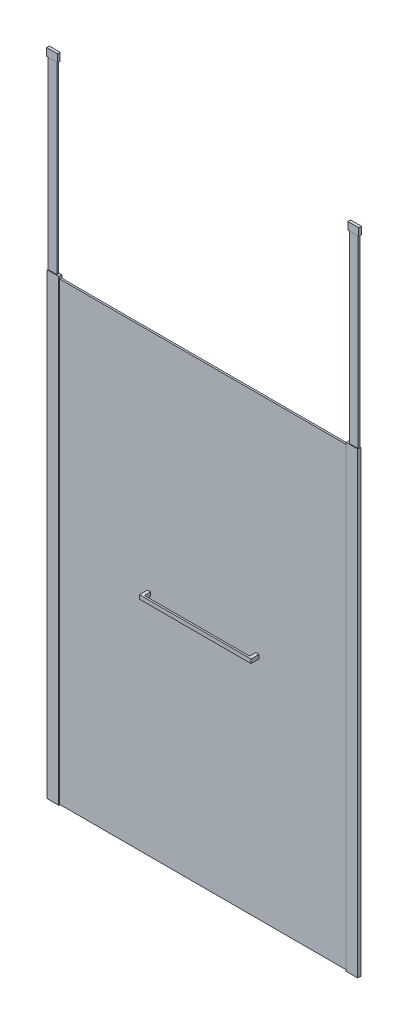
ISO-10303-21;
HEADER;
FILE_DESCRIPTION(('STEP AP214'),'2;1');
FILE_NAME('part.step','',(''),(''),'','','');
FILE_SCHEMA(('AUTOMOTIVE_DESIGN { 1 0 10303 214 1 1 1 1 }'));
ENDSEC;
DATA;
#1=APPLICATION_CONTEXT('core data for automotive mechanical design processes');
#2=APPLICATION_PROTOCOL_DEFINITION('international standard','automotive_design',2000,#1);
#3=PRODUCT_CONTEXT('',#1,'mechanical');
#4=PRODUCT('Part','Part','',(#3));
#5=PRODUCT_RELATED_PRODUCT_CATEGORY('part','',(#4));
#6=PRODUCT_DEFINITION_FORMATION('','',#4);
#7=PRODUCT_DEFINITION_CONTEXT('part definition',#1,'design');
#8=PRODUCT_DEFINITION('design','',#6,#7);
#9=PRODUCT_DEFINITION_SHAPE('','',#8);
#10=(LENGTH_UNIT() NAMED_UNIT(*) SI_UNIT(.MILLI.,.METRE.));
#11=(NAMED_UNIT(*) PLANE_ANGLE_UNIT() SI_UNIT($,.RADIAN.));
#12=(NAMED_UNIT(*) SI_UNIT($,.STERADIAN.) SOLID_ANGLE_UNIT());
#13=UNCERTAINTY_MEASURE_WITH_UNIT(LENGTH_MEASURE(1.E-05),#10,'distance_accuracy_value','');
#14=(GEOMETRIC_REPRESENTATION_CONTEXT(3) GLOBAL_UNCERTAINTY_ASSIGNED_CONTEXT((#13)) GLOBAL_UNIT_ASSIGNED_CONTEXT((#10,
#11,#12)) REPRESENTATION_CONTEXT('',''));
#15=CARTESIAN_POINT('',(0.,0.,0.));
#16=DIRECTION('',(0.,0.,1.));
#17=DIRECTION('',(1.,0.,0.));
#18=AXIS2_PLACEMENT_3D('',#15,#16,#17);
#19=CARTESIAN_POINT('',(473.9,1062.,-21.));
#20=DIRECTION('',(1.,0.,0.));
#21=DIRECTION('',(0.,0.,-1.));
#22=AXIS2_PLACEMENT_3D('',#19,#20,#21);
#23=PLANE('',#22);
#24=DIRECTION('',(0.,1.,0.));
#25=VECTOR('',#24,1.);
#26=CARTESIAN_POINT('',(473.9,1062.,25.5));
#27=LINE('',#26,#25);
#28=CARTESIAN_POINT('',(473.9,1044.,25.5));
#29=VERTEX_POINT('',#28);
#30=CARTESIAN_POINT('',(473.9,1062.,25.5));
#31=VERTEX_POINT('',#30);
#32=EDGE_CURVE('E63',#29,#31,#27,.T.);
#33=ORIENTED_EDGE('',*,*,#32,.F.);
#34=DIRECTION('',(0.,0.,1.));
#35=VECTOR('',#34,1.);
#36=CARTESIAN_POINT('',(473.9,1044.,-21.));
#37=LINE('',#36,#35);
#38=CARTESIAN_POINT('',(473.9,1044.,-21.));
#39=VERTEX_POINT('',#38);
#40=EDGE_CURVE('E12',#39,#29,#37,.T.);
#41=ORIENTED_EDGE('',*,*,#40,.F.);
#42=DIRECTION('',(0.,1.,0.));
#43=VECTOR('',#42,1.);
#44=CARTESIAN_POINT('',(473.9,1062.,-21.));
#45=LINE('',#44,#43);
#46=CARTESIAN_POINT('',(473.9,1062.,-21.));
#47=VERTEX_POINT('',#46);
#48=EDGE_CURVE('E193',#39,#47,#45,.T.);
#49=ORIENTED_EDGE('',*,*,#48,.T.);
#50=DIRECTION('',(0.,0.,1.));
#51=VECTOR('',#50,1.);
#52=CARTESIAN_POINT('',(473.9,1062.,-21.));
#53=LINE('',#52,#51);
#54=EDGE_CURVE('E176',#47,#31,#53,.T.);
#55=ORIENTED_EDGE('',*,*,#54,.T.);
#56=EDGE_LOOP('',(#33,#41,#49,#55));
#57=FACE_BOUND('',#56,.T.);
#58=ADVANCED_FACE('F46',(#57),#23,.T.);
#59=CARTESIAN_POINT('',(458.9,1044.,-21.));
#60=DIRECTION('',(0.,-1.,0.));
#61=DIRECTION('',(0.,0.,-1.));
#62=AXIS2_PLACEMENT_3D('',#59,#60,#61);
#63=PLANE('',#62);
#64=ORIENTED_EDGE('',*,*,#40,.T.);
#65=DIRECTION('',(-1.,0.,0.));
#66=VECTOR('',#65,1.);
#67=CARTESIAN_POINT('',(978.597715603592,1044.,25.5));
#68=LINE('',#67,#66);
#69=CARTESIAN_POINT('',(958.9,1044.,25.5));
#70=VERTEX_POINT('',#69);
#71=EDGE_CURVE('E166',#70,#29,#68,.T.);
#72=ORIENTED_EDGE('',*,*,#71,.F.);
#73=DIRECTION('',(0.,0.,1.));
#74=VECTOR('',#73,1.);
#75=CARTESIAN_POINT('',(958.9,1044.,-21.));
#76=LINE('',#75,#74);
#77=CARTESIAN_POINT('',(958.9,1044.,-21.));
#78=VERTEX_POINT('',#77);
#79=EDGE_CURVE('E149',#78,#70,#76,.T.);
#80=ORIENTED_EDGE('',*,*,#79,.F.);
#81=DIRECTION('',(1.,0.,0.));
#82=VECTOR('',#81,1.);
#83=CARTESIAN_POINT('',(958.9,1044.,-21.));
#84=LINE('',#83,#82);
#85=CARTESIAN_POINT('',(973.9,1044.,-21.));
#86=VERTEX_POINT('',#85);
#87=EDGE_CURVE('E131',#78,#86,#84,.T.);
#88=ORIENTED_EDGE('',*,*,#87,.T.);
#89=DIRECTION('',(0.,0.,1.));
#90=VECTOR('',#89,1.);
#91=CARTESIAN_POINT('',(973.9,1044.,-21.));
#92=LINE('',#91,#90);
#93=CARTESIAN_POINT('',(973.9,1044.,33.5));
#94=VERTEX_POINT('',#93);
#95=EDGE_CURVE('E147',#86,#94,#92,.T.);
#96=ORIENTED_EDGE('',*,*,#95,.T.);
#97=DIRECTION('',(1.,0.,0.));
#98=VECTOR('',#97,1.);
#99=CARTESIAN_POINT('',(458.9,1044.,33.5));
#100=LINE('',#99,#98);
#101=CARTESIAN_POINT('',(458.9,1044.,33.5));
#102=VERTEX_POINT('',#101);
#103=EDGE_CURVE('E135',#102,#94,#100,.T.);
#104=ORIENTED_EDGE('',*,*,#103,.F.);
#105=DIRECTION('',(0.,0.,1.));
#106=VECTOR('',#105,1.);
#107=CARTESIAN_POINT('',(458.9,1044.,-21.));
#108=LINE('',#107,#106);
#109=CARTESIAN_POINT('',(458.9,1044.,-21.));
#110=VERTEX_POINT('',#109);
#111=EDGE_CURVE('E55',#110,#102,#108,.T.);
#112=ORIENTED_EDGE('',*,*,#111,.F.);
#113=DIRECTION('',(1.,0.,0.));
#114=VECTOR('',#113,1.);
#115=CARTESIAN_POINT('',(458.9,1044.,-21.));
#116=LINE('',#115,#114);
#117=EDGE_CURVE('E181',#110,#39,#116,.T.);
#118=ORIENTED_EDGE('',*,*,#117,.T.);
#119=EDGE_LOOP('',(#64,#72,#80,#88,#96,#104,#112,#118));
#120=FACE_BOUND('',#119,.T.);
#121=ADVANCED_FACE('F197',(#120),#63,.T.);
#122=CARTESIAN_POINT('',(458.9,1062.,-21.));
#123=DIRECTION('',(-1.,0.,0.));
#124=DIRECTION('',(0.,0.,1.));
#125=AXIS2_PLACEMENT_3D('',#122,#123,#124);
#126=PLANE('',#125);
#127=ORIENTED_EDGE('',*,*,#111,.T.);
#128=DIRECTION('',(0.,-1.,0.));
#129=VECTOR('',#128,1.);
#130=CARTESIAN_POINT('',(458.9,1062.,33.5));
#131=LINE('',#130,#129);
#132=CARTESIAN_POINT('',(458.9,1062.,33.5));
#133=VERTEX_POINT('',#132);
#134=EDGE_CURVE('E121',#133,#102,#131,.T.);
#135=ORIENTED_EDGE('',*,*,#134,.F.);
#136=DIRECTION('',(0.,0.,1.));
#137=VECTOR('',#136,1.);
#138=CARTESIAN_POINT('',(458.9,1062.,-21.));
#139=LINE('',#138,#137);
#140=CARTESIAN_POINT('',(458.9,1062.,-21.));
#141=VERTEX_POINT('',#140);
#142=EDGE_CURVE('E116',#141,#133,#139,.T.);
#143=ORIENTED_EDGE('',*,*,#142,.F.);
#144=DIRECTION('',(0.,-1.,0.));
#145=VECTOR('',#144,1.);
#146=CARTESIAN_POINT('',(458.9,1062.,-21.));
#147=LINE('',#146,#145);
#148=EDGE_CURVE('E186',#141,#110,#147,.T.);
#149=ORIENTED_EDGE('',*,*,#148,.T.);
#150=EDGE_LOOP('',(#127,#135,#143,#149));
#151=FACE_BOUND('',#150,.T.);
#152=ADVANCED_FACE('F218',(#151),#126,.T.);
#153=CARTESIAN_POINT('',(458.9,1062.,-21.));
#154=DIRECTION('',(0.,1.,0.));
#155=DIRECTION('',(0.,0.,1.));
#156=AXIS2_PLACEMENT_3D('',#153,#154,#155);
#157=PLANE('',#156);
#158=ORIENTED_EDGE('',*,*,#142,.T.);
#159=DIRECTION('',(-1.,0.,0.));
#160=VECTOR('',#159,1.);
#161=CARTESIAN_POINT('',(458.9,1062.,33.5));
#162=LINE('',#161,#160);
#163=CARTESIAN_POINT('',(973.9,1062.,33.5));
#164=VERTEX_POINT('',#163);
#165=EDGE_CURVE('E109',#164,#133,#162,.T.);
#166=ORIENTED_EDGE('',*,*,#165,.F.);
#167=DIRECTION('',(0.,0.,1.));
#168=VECTOR('',#167,1.);
#169=CARTESIAN_POINT('',(973.9,1062.,-21.));
#170=LINE('',#169,#168);
#171=CARTESIAN_POINT('',(973.9,1062.,-21.));
#172=VERTEX_POINT('',#171);
#173=EDGE_CURVE('E113',#172,#164,#170,.T.);
#174=ORIENTED_EDGE('',*,*,#173,.F.);
#175=DIRECTION('',(-1.,0.,0.));
#176=VECTOR('',#175,1.);
#177=CARTESIAN_POINT('',(958.9,1062.,-21.));
#178=LINE('',#177,#176);
#179=CARTESIAN_POINT('',(958.9,1062.,-21.));
#180=VERTEX_POINT('',#179);
#181=EDGE_CURVE('E138',#172,#180,#178,.T.);
#182=ORIENTED_EDGE('',*,*,#181,.T.);
#183=DIRECTION('',(0.,0.,1.));
#184=VECTOR('',#183,1.);
#185=CARTESIAN_POINT('',(958.9,1062.,-21.));
#186=LINE('',#185,#184);
#187=CARTESIAN_POINT('',(958.9,1062.,25.5));
#188=VERTEX_POINT('',#187);
#189=EDGE_CURVE('E130',#180,#188,#186,.T.);
#190=ORIENTED_EDGE('',*,*,#189,.T.);
#191=DIRECTION('',(-1.,0.,0.));
#192=VECTOR('',#191,1.);
#193=CARTESIAN_POINT('',(978.597715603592,1062.,25.5));
#194=LINE('',#193,#192);
#195=EDGE_CURVE('E163',#188,#31,#194,.T.);
#196=ORIENTED_EDGE('',*,*,#195,.T.);
#197=ORIENTED_EDGE('',*,*,#54,.F.);
#198=DIRECTION('',(-1.,0.,0.));
#199=VECTOR('',#198,1.);
#200=CARTESIAN_POINT('',(458.9,1062.,-21.));
#201=LINE('',#200,#199);
#202=EDGE_CURVE('E190',#47,#141,#201,.T.);
#203=ORIENTED_EDGE('',*,*,#202,.T.);
#204=EDGE_LOOP('',(#158,#166,#174,#182,#190,#196,#197,#203));
#205=FACE_BOUND('',#204,.T.);
#206=ADVANCED_FACE('F111',(#205),#157,.T.);
#207=CARTESIAN_POINT('',(473.9,1044.,-21.));
#208=DIRECTION('',(0.,0.,1.));
#209=DIRECTION('',(1.,0.,0.));
#210=AXIS2_PLACEMENT_3D('',#207,#208,#209);
#211=PLANE('',#210);
#212=ORIENTED_EDGE('',*,*,#48,.F.);
#213=ORIENTED_EDGE('',*,*,#117,.F.);
#214=ORIENTED_EDGE('',*,*,#148,.F.);
#215=ORIENTED_EDGE('',*,*,#202,.F.);
#216=EDGE_LOOP('',(#212,#213,#214,#215));
#217=FACE_BOUND('',#216,.T.);
#218=ADVANCED_FACE('F225',(#217),#211,.F.);
#219=CARTESIAN_POINT('',(473.9,1044.,33.5));
#220=DIRECTION('',(0.,0.,1.));
#221=DIRECTION('',(1.,0.,0.));
#222=AXIS2_PLACEMENT_3D('',#219,#220,#221);
#223=PLANE('',#222);
#224=ORIENTED_EDGE('',*,*,#103,.T.);
#225=DIRECTION('',(0.,1.,0.));
#226=VECTOR('',#225,1.);
#227=CARTESIAN_POINT('',(973.9,1062.,33.5));
#228=LINE('',#227,#226);
#229=EDGE_CURVE('E127',#94,#164,#228,.T.);
#230=ORIENTED_EDGE('',*,*,#229,.T.);
#231=ORIENTED_EDGE('',*,*,#165,.T.);
#232=ORIENTED_EDGE('',*,*,#134,.T.);
#233=EDGE_LOOP('',(#224,#230,#231,#232));
#234=FACE_BOUND('',#233,.T.);
#235=ADVANCED_FACE('F133',(#234),#223,.T.);
#236=CARTESIAN_POINT('',(978.597715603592,1062.,25.5));
#237=DIRECTION('',(0.,0.,1.));
#238=DIRECTION('',(0.,-1.,0.));
#239=AXIS2_PLACEMENT_3D('',#236,#237,#238);
#240=PLANE('',#239);
#241=ORIENTED_EDGE('',*,*,#195,.F.);
#242=DIRECTION('',(0.,-1.,0.));
#243=VECTOR('',#242,1.);
#244=CARTESIAN_POINT('',(958.9,1062.,25.5));
#245=LINE('',#244,#243);
#246=EDGE_CURVE('E49',#188,#70,#245,.T.);
#247=ORIENTED_EDGE('',*,*,#246,.T.);
#248=ORIENTED_EDGE('',*,*,#71,.T.);
#249=ORIENTED_EDGE('',*,*,#32,.T.);
#250=EDGE_LOOP('',(#241,#247,#248,#249));
#251=FACE_BOUND('',#250,.T.);
#252=ADVANCED_FACE('F203',(#251),#240,.F.);
#253=CARTESIAN_POINT('',(958.9,1062.,-21.));
#254=DIRECTION('',(-1.,0.,0.));
#255=DIRECTION('',(0.,0.,1.));
#256=AXIS2_PLACEMENT_3D('',#253,#254,#255);
#257=PLANE('',#256);
#258=ORIENTED_EDGE('',*,*,#246,.F.);
#259=ORIENTED_EDGE('',*,*,#189,.F.);
#260=DIRECTION('',(0.,-1.,0.));
#261=VECTOR('',#260,1.);
#262=CARTESIAN_POINT('',(958.9,1062.,-21.));
#263=LINE('',#262,#261);
#264=EDGE_CURVE('E142',#180,#78,#263,.T.);
#265=ORIENTED_EDGE('',*,*,#264,.T.);
#266=ORIENTED_EDGE('',*,*,#79,.T.);
#267=EDGE_LOOP('',(#258,#259,#265,#266));
#268=FACE_BOUND('',#267,.T.);
#269=ADVANCED_FACE('F204',(#268),#257,.T.);
#270=CARTESIAN_POINT('',(973.9,1062.,-21.));
#271=DIRECTION('',(1.,0.,0.));
#272=DIRECTION('',(0.,0.,-1.));
#273=AXIS2_PLACEMENT_3D('',#270,#271,#272);
#274=PLANE('',#273);
#275=ORIENTED_EDGE('',*,*,#173,.T.);
#276=ORIENTED_EDGE('',*,*,#229,.F.);
#277=ORIENTED_EDGE('',*,*,#95,.F.);
#278=DIRECTION('',(0.,1.,0.));
#279=VECTOR('',#278,1.);
#280=CARTESIAN_POINT('',(973.9,1062.,-21.));
#281=LINE('',#280,#279);
#282=EDGE_CURVE('E129',#86,#172,#281,.T.);
#283=ORIENTED_EDGE('',*,*,#282,.T.);
#284=EDGE_LOOP('',(#275,#276,#277,#283));
#285=FACE_BOUND('',#284,.T.);
#286=ADVANCED_FACE('F126',(#285),#274,.T.);
#287=CARTESIAN_POINT('',(973.9,1044.,-21.));
#288=DIRECTION('',(0.,0.,1.));
#289=DIRECTION('',(1.,0.,0.));
#290=AXIS2_PLACEMENT_3D('',#287,#288,#289);
#291=PLANE('',#290);
#292=ORIENTED_EDGE('',*,*,#282,.F.);
#293=ORIENTED_EDGE('',*,*,#87,.F.);
#294=ORIENTED_EDGE('',*,*,#264,.F.);
#295=ORIENTED_EDGE('',*,*,#181,.F.);
#296=EDGE_LOOP('',(#292,#293,#294,#295));
#297=FACE_BOUND('',#296,.T.);
#298=ADVANCED_FACE('F200',(#297),#291,.F.);
#299=CLOSED_SHELL('',(#58,#121,#152,#206,#218,#235,#252,#269,#286,#298));
#300=MANIFOLD_SOLID_BREP('B2',#299);
#301=CARTESIAN_POINT('',(46.5,3000.,-13.2499999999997));
#302=DIRECTION('',(-1.,0.,0.));
#303=DIRECTION('',(0.,-1.,0.));
#304=AXIS2_PLACEMENT_3D('',#301,#302,#303);
#305=PLANE('',#304);
#306=DIRECTION('',(0.,0.,-1.));
#307=VECTOR('',#306,1.);
#308=CARTESIAN_POINT('',(46.5,2965.,-13.2499999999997));
#309=LINE('',#308,#307);
#310=CARTESIAN_POINT('',(46.5,2965.,-0.749999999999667));
#311=VERTEX_POINT('',#310);
#312=CARTESIAN_POINT('',(46.5,2965.,-13.2499999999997));
#313=VERTEX_POINT('',#312);
#314=EDGE_CURVE('E381',#311,#313,#309,.T.);
#315=ORIENTED_EDGE('',*,*,#314,.T.);
#316=DIRECTION('',(0.,-1.,0.));
#317=VECTOR('',#316,1.);
#318=CARTESIAN_POINT('',(46.5,3000.,-13.2499999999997));
#319=LINE('',#318,#317);
#320=CARTESIAN_POINT('',(46.5,3000.,-13.2499999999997));
#321=VERTEX_POINT('',#320);
#322=EDGE_CURVE('E44',#321,#313,#319,.T.);
#323=ORIENTED_EDGE('',*,*,#322,.F.);
#324=DIRECTION('',(0.,0.,-1.));
#325=VECTOR('',#324,1.);
#326=CARTESIAN_POINT('',(46.5,3000.,-13.2499999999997));
#327=LINE('',#326,#325);
#328=CARTESIAN_POINT('',(46.5,3000.,-0.74999999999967));
#329=VERTEX_POINT('',#328);
#330=EDGE_CURVE('E369',#329,#321,#327,.T.);
#331=ORIENTED_EDGE('',*,*,#330,.F.);
#332=DIRECTION('',(0.,-1.,0.));
#333=VECTOR('',#332,1.);
#334=CARTESIAN_POINT('',(46.5,3000.,-0.74999999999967));
#335=LINE('',#334,#333);
#336=EDGE_CURVE('E377',#329,#311,#335,.T.);
#337=ORIENTED_EDGE('',*,*,#336,.T.);
#338=EDGE_LOOP('',(#315,#323,#331,#337));
#339=FACE_BOUND('',#338,.T.);
#340=ADVANCED_FACE('F318',(#339),#305,.F.);
#341=CARTESIAN_POINT('',(-3.5,3000.,-13.2499999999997));
#342=DIRECTION('',(0.,0.,1.));
#343=DIRECTION('',(0.,-1.,0.));
#344=AXIS2_PLACEMENT_3D('',#341,#342,#343);
#345=PLANE('',#344);
#346=DIRECTION('',(-1.,0.,0.));
#347=VECTOR('',#346,1.);
#348=CARTESIAN_POINT('',(-3.5,2965.,-13.2499999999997));
#349=LINE('',#348,#347);
#350=CARTESIAN_POINT('',(-3.5,2965.,-13.2499999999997));
#351=VERTEX_POINT('',#350);
#352=EDGE_CURVE('E373',#313,#351,#349,.T.);
#353=ORIENTED_EDGE('',*,*,#352,.T.);
#354=DIRECTION('',(0.,-1.,0.));
#355=VECTOR('',#354,1.);
#356=CARTESIAN_POINT('',(-3.5,3000.,-13.2499999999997));
#357=LINE('',#356,#355);
#358=CARTESIAN_POINT('',(-3.5,3000.,-13.2499999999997));
#359=VERTEX_POINT('',#358);
#360=EDGE_CURVE('E326',#359,#351,#357,.T.);
#361=ORIENTED_EDGE('',*,*,#360,.F.);
#362=DIRECTION('',(-1.,0.,0.));
#363=VECTOR('',#362,1.);
#364=CARTESIAN_POINT('',(-3.5,3000.,-13.2499999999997));
#365=LINE('',#364,#363);
#366=EDGE_CURVE('E364',#321,#359,#365,.T.);
#367=ORIENTED_EDGE('',*,*,#366,.F.);
#368=ORIENTED_EDGE('',*,*,#322,.T.);
#369=EDGE_LOOP('',(#353,#361,#367,#368));
#370=FACE_BOUND('',#369,.T.);
#371=ADVANCED_FACE('F372',(#370),#345,.F.);
#372=CARTESIAN_POINT('',(-3.5,3000.,-13.2499999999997));
#373=DIRECTION('',(1.,0.,0.));
#374=DIRECTION('',(0.,0.,-1.));
#375=AXIS2_PLACEMENT_3D('',#372,#373,#374);
#376=PLANE('',#375);
#377=DIRECTION('',(0.,0.,1.));
#378=VECTOR('',#377,1.);
#379=CARTESIAN_POINT('',(-3.5,2965.,-13.2499999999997));
#380=LINE('',#379,#378);
#381=CARTESIAN_POINT('',(-3.5,2965.,-0.749999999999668));
#382=VERTEX_POINT('',#381);
#383=EDGE_CURVE('E351',#351,#382,#380,.T.);
#384=ORIENTED_EDGE('',*,*,#383,.T.);
#385=DIRECTION('',(0.,-1.,0.));
#386=VECTOR('',#385,1.);
#387=CARTESIAN_POINT('',(-3.5,3000.,-0.74999999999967));
#388=LINE('',#387,#386);
#389=CARTESIAN_POINT('',(-3.5,3000.,-0.74999999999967));
#390=VERTEX_POINT('',#389);
#391=EDGE_CURVE('E374',#390,#382,#388,.T.);
#392=ORIENTED_EDGE('',*,*,#391,.F.);
#393=DIRECTION('',(0.,0.,1.));
#394=VECTOR('',#393,1.);
#395=CARTESIAN_POINT('',(-3.5,3000.,-13.2499999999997));
#396=LINE('',#395,#394);
#397=EDGE_CURVE('E367',#359,#390,#396,.T.);
#398=ORIENTED_EDGE('',*,*,#397,.F.);
#399=ORIENTED_EDGE('',*,*,#360,.T.);
#400=EDGE_LOOP('',(#384,#392,#398,#399));
#401=FACE_BOUND('',#400,.T.);
#402=ADVANCED_FACE('F375',(#401),#376,.F.);
#403=CARTESIAN_POINT('',(-3.5,3000.,-0.74999999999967));
#404=DIRECTION('',(0.,0.,-1.));
#405=DIRECTION('',(0.,1.,0.));
#406=AXIS2_PLACEMENT_3D('',#403,#404,#405);
#407=PLANE('',#406);
#408=DIRECTION('',(1.,0.,0.));
#409=VECTOR('',#408,1.);
#410=CARTESIAN_POINT('',(-3.5,2965.,-0.749999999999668));
#411=LINE('',#410,#409);
#412=EDGE_CURVE('E357',#382,#311,#411,.T.);
#413=ORIENTED_EDGE('',*,*,#412,.T.);
#414=ORIENTED_EDGE('',*,*,#336,.F.);
#415=DIRECTION('',(1.,0.,0.));
#416=VECTOR('',#415,1.);
#417=CARTESIAN_POINT('',(-3.5,3000.,-0.74999999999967));
#418=LINE('',#417,#416);
#419=EDGE_CURVE('E334',#390,#329,#418,.T.);
#420=ORIENTED_EDGE('',*,*,#419,.F.);
#421=ORIENTED_EDGE('',*,*,#391,.T.);
#422=EDGE_LOOP('',(#413,#414,#420,#421));
#423=FACE_BOUND('',#422,.T.);
#424=ADVANCED_FACE('F388',(#423),#407,.F.);
#425=CARTESIAN_POINT('',(46.5,3000.,-0.74999999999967));
#426=DIRECTION('',(0.,1.,0.));
#427=DIRECTION('',(0.,0.,1.));
#428=AXIS2_PLACEMENT_3D('',#425,#426,#427);
#429=PLANE('',#428);
#430=ORIENTED_EDGE('',*,*,#330,.T.);
#431=ORIENTED_EDGE('',*,*,#366,.T.);
#432=ORIENTED_EDGE('',*,*,#397,.T.);
#433=ORIENTED_EDGE('',*,*,#419,.T.);
#434=EDGE_LOOP('',(#430,#431,#432,#433));
#435=FACE_BOUND('',#434,.T.);
#436=ADVANCED_FACE('F365',(#435),#429,.T.);
#437=CARTESIAN_POINT('',(46.5,2965.,-0.749999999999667));
#438=DIRECTION('',(0.,1.,0.));
#439=DIRECTION('',(0.,0.,1.));
#440=AXIS2_PLACEMENT_3D('',#437,#438,#439);
#441=PLANE('',#440);
#442=ORIENTED_EDGE('',*,*,#314,.F.);
#443=ORIENTED_EDGE('',*,*,#412,.F.);
#444=ORIENTED_EDGE('',*,*,#383,.F.);
#445=ORIENTED_EDGE('',*,*,#352,.F.);
#446=EDGE_LOOP('',(#442,#443,#444,#445));
#447=FACE_BOUND('',#446,.T.);
#448=ADVANCED_FACE('F391',(#447),#441,.F.);
#449=CLOSED_SHELL('',(#340,#371,#402,#424,#436,#448));
#450=MANIFOLD_SOLID_BREP('B6',#449);
#451=CARTESIAN_POINT('',(1.5,2997.,-2.99999999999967));
#452=DIRECTION('',(-1.,0.,0.));
#453=DIRECTION('',(0.,0.,1.));
#454=AXIS2_PLACEMENT_3D('',#451,#452,#453);
#455=PLANE('',#454);
#456=DIRECTION('',(0.,0.,-1.));
#457=VECTOR('',#456,1.);
#458=CARTESIAN_POINT('',(1.5,2114.,-2.99999999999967));
#459=LINE('',#458,#457);
#460=CARTESIAN_POINT('',(1.5,2114.,-2.99999999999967));
#461=VERTEX_POINT('',#460);
#462=CARTESIAN_POINT('',(1.5,2114.,-10.9999999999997));
#463=VERTEX_POINT('',#462);
#464=EDGE_CURVE('E516',#461,#463,#459,.T.);
#465=ORIENTED_EDGE('',*,*,#464,.F.);
#466=DIRECTION('',(0.,-1.,0.));
#467=VECTOR('',#466,1.);
#468=CARTESIAN_POINT('',(1.5,2997.,-2.99999999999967));
#469=LINE('',#468,#467);
#470=CARTESIAN_POINT('',(1.5,2997.,-2.99999999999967));
#471=VERTEX_POINT('',#470);
#472=EDGE_CURVE('E316',#471,#461,#469,.T.);
#473=ORIENTED_EDGE('',*,*,#472,.F.);
#474=DIRECTION('',(0.,0.,-1.));
#475=VECTOR('',#474,1.);
#476=CARTESIAN_POINT('',(1.5,2997.,-2.99999999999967));
#477=LINE('',#476,#475);
#478=CARTESIAN_POINT('',(1.5,2997.,-10.9999999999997));
#479=VERTEX_POINT('',#478);
#480=EDGE_CURVE('E510',#471,#479,#477,.T.);
#481=ORIENTED_EDGE('',*,*,#480,.T.);
#482=DIRECTION('',(0.,-1.,0.));
#483=VECTOR('',#482,1.);
#484=CARTESIAN_POINT('',(1.5,2997.,-10.9999999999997));
#485=LINE('',#484,#483);
#486=EDGE_CURVE('E455',#479,#463,#485,.T.);
#487=ORIENTED_EDGE('',*,*,#486,.T.);
#488=EDGE_LOOP('',(#465,#473,#481,#487));
#489=FACE_BOUND('',#488,.T.);
#490=ADVANCED_FACE('F452',(#489),#455,.T.);
#491=CARTESIAN_POINT('',(1.5,2997.,-2.99999999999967));
#492=DIRECTION('',(0.,0.,1.));
#493=DIRECTION('',(1.,0.,0.));
#494=AXIS2_PLACEMENT_3D('',#491,#492,#493);
#495=PLANE('',#494);
#496=DIRECTION('',(-1.,0.,0.));
#497=VECTOR('',#496,1.);
#498=CARTESIAN_POINT('',(1.5,2114.,-2.99999999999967));
#499=LINE('',#498,#497);
#500=CARTESIAN_POINT('',(41.5,2114.,-2.99999999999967));
#501=VERTEX_POINT('',#500);
#502=EDGE_CURVE('E512',#501,#461,#499,.T.);
#503=ORIENTED_EDGE('',*,*,#502,.F.);
#504=DIRECTION('',(0.,-1.,0.));
#505=VECTOR('',#504,1.);
#506=CARTESIAN_POINT('',(41.5,2997.,-2.99999999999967));
#507=LINE('',#506,#505);
#508=CARTESIAN_POINT('',(41.5,2997.,-2.99999999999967));
#509=VERTEX_POINT('',#508);
#510=EDGE_CURVE('E461',#509,#501,#507,.T.);
#511=ORIENTED_EDGE('',*,*,#510,.F.);
#512=DIRECTION('',(-1.,0.,0.));
#513=VECTOR('',#512,1.);
#514=CARTESIAN_POINT('',(1.5,2997.,-2.99999999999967));
#515=LINE('',#514,#513);
#516=EDGE_CURVE('E507',#509,#471,#515,.T.);
#517=ORIENTED_EDGE('',*,*,#516,.T.);
#518=ORIENTED_EDGE('',*,*,#472,.T.);
#519=EDGE_LOOP('',(#503,#511,#517,#518));
#520=FACE_BOUND('',#519,.T.);
#521=ADVANCED_FACE('F526',(#520),#495,.T.);
#522=CARTESIAN_POINT('',(41.5,2997.,-2.99999999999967));
#523=DIRECTION('',(1.,0.,0.));
#524=DIRECTION('',(0.,0.,-1.));
#525=AXIS2_PLACEMENT_3D('',#522,#523,#524);
#526=PLANE('',#525);
#527=DIRECTION('',(0.,0.,1.));
#528=VECTOR('',#527,1.);
#529=CARTESIAN_POINT('',(41.5,2114.,-2.99999999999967));
#530=LINE('',#529,#528);
#531=CARTESIAN_POINT('',(41.5,2114.,-10.9999999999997));
#532=VERTEX_POINT('',#531);
#533=EDGE_CURVE('E502',#532,#501,#530,.T.);
#534=ORIENTED_EDGE('',*,*,#533,.F.);
#535=DIRECTION('',(0.,-1.,0.));
#536=VECTOR('',#535,1.);
#537=CARTESIAN_POINT('',(41.5,2997.,-10.9999999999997));
#538=LINE('',#537,#536);
#539=CARTESIAN_POINT('',(41.5,2997.,-10.9999999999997));
#540=VERTEX_POINT('',#539);
#541=EDGE_CURVE('E497',#540,#532,#538,.T.);
#542=ORIENTED_EDGE('',*,*,#541,.F.);
#543=DIRECTION('',(0.,0.,1.));
#544=VECTOR('',#543,1.);
#545=CARTESIAN_POINT('',(41.5,2997.,-2.99999999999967));
#546=LINE('',#545,#544);
#547=EDGE_CURVE('E500',#540,#509,#546,.T.);
#548=ORIENTED_EDGE('',*,*,#547,.T.);
#549=ORIENTED_EDGE('',*,*,#510,.T.);
#550=EDGE_LOOP('',(#534,#542,#548,#549));
#551=FACE_BOUND('',#550,.T.);
#552=ADVANCED_FACE('F499',(#551),#526,.T.);
#553=CARTESIAN_POINT('',(1.5,2997.,-10.9999999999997));
#554=DIRECTION('',(0.,0.,-1.));
#555=DIRECTION('',(-1.,0.,0.));
#556=AXIS2_PLACEMENT_3D('',#553,#554,#555);
#557=PLANE('',#556);
#558=DIRECTION('',(1.,0.,0.));
#559=VECTOR('',#558,1.);
#560=CARTESIAN_POINT('',(1.5,2114.,-10.9999999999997));
#561=LINE('',#560,#559);
#562=EDGE_CURVE('E519',#463,#532,#561,.T.);
#563=ORIENTED_EDGE('',*,*,#562,.F.);
#564=ORIENTED_EDGE('',*,*,#486,.F.);
#565=DIRECTION('',(1.,0.,0.));
#566=VECTOR('',#565,1.);
#567=CARTESIAN_POINT('',(1.5,2997.,-10.9999999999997));
#568=LINE('',#567,#566);
#569=EDGE_CURVE('E506',#479,#540,#568,.T.);
#570=ORIENTED_EDGE('',*,*,#569,.T.);
#571=ORIENTED_EDGE('',*,*,#541,.T.);
#572=EDGE_LOOP('',(#563,#564,#570,#571));
#573=FACE_BOUND('',#572,.T.);
#574=ADVANCED_FACE('F509',(#573),#557,.T.);
#575=CARTESIAN_POINT('',(1.5,2997.,-10.9999999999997));
#576=DIRECTION('',(0.,-1.,0.));
#577=DIRECTION('',(0.,0.,-1.));
#578=AXIS2_PLACEMENT_3D('',#575,#576,#577);
#579=PLANE('',#578);
#580=ORIENTED_EDGE('',*,*,#480,.F.);
#581=ORIENTED_EDGE('',*,*,#516,.F.);
#582=ORIENTED_EDGE('',*,*,#547,.F.);
#583=ORIENTED_EDGE('',*,*,#569,.F.);
#584=EDGE_LOOP('',(#580,#581,#582,#583));
#585=FACE_BOUND('',#584,.T.);
#586=ADVANCED_FACE('F505',(#585),#579,.F.);
#587=CARTESIAN_POINT('',(1.5,2114.,-10.9999999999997));
#588=DIRECTION('',(0.,-1.,0.));
#589=DIRECTION('',(0.,0.,-1.));
#590=AXIS2_PLACEMENT_3D('',#587,#588,#589);
#591=PLANE('',#590);
#592=ORIENTED_EDGE('',*,*,#464,.T.);
#593=ORIENTED_EDGE('',*,*,#562,.T.);
#594=ORIENTED_EDGE('',*,*,#533,.T.);
#595=ORIENTED_EDGE('',*,*,#502,.T.);
#596=EDGE_LOOP('',(#592,#593,#594,#595));
#597=FACE_BOUND('',#596,.T.);
#598=ADVANCED_FACE('F525',(#597),#591,.T.);
#599=CLOSED_SHELL('',(#490,#521,#552,#574,#586,#598));
#600=MANIFOLD_SOLID_BREP('B38',#599);
#601=CARTESIAN_POINT('',(1386.3,3000.,-0.749999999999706));
#602=DIRECTION('',(1.,0.,0.));
#603=DIRECTION('',(0.,1.,0.));
#604=AXIS2_PLACEMENT_3D('',#601,#602,#603);
#605=PLANE('',#604);
#606=DIRECTION('',(0.,0.,1.));
#607=VECTOR('',#606,1.);
#608=CARTESIAN_POINT('',(1386.3,2965.,-0.749999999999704));
#609=LINE('',#608,#607);
#610=CARTESIAN_POINT('',(1386.3,2965.,-13.2499999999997));
#611=VERTEX_POINT('',#610);
#612=CARTESIAN_POINT('',(1386.3,2965.,-0.749999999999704));
#613=VERTEX_POINT('',#612);
#614=EDGE_CURVE('E674',#611,#613,#609,.T.);
#615=ORIENTED_EDGE('',*,*,#614,.T.);
#616=DIRECTION('',(0.,-1.,0.));
#617=VECTOR('',#616,1.);
#618=CARTESIAN_POINT('',(1386.3,3000.,-0.749999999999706));
#619=LINE('',#618,#617);
#620=CARTESIAN_POINT('',(1386.3,3000.,-0.749999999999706));
#621=VERTEX_POINT('',#620);
#622=EDGE_CURVE('E655',#621,#613,#619,.T.);
#623=ORIENTED_EDGE('',*,*,#622,.F.);
#624=DIRECTION('',(0.,0.,1.));
#625=VECTOR('',#624,1.);
#626=CARTESIAN_POINT('',(1386.3,3000.,-0.749999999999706));
#627=LINE('',#626,#625);
#628=CARTESIAN_POINT('',(1386.3,3000.,-13.2499999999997));
#629=VERTEX_POINT('',#628);
#630=EDGE_CURVE('E662',#629,#621,#627,.T.);
#631=ORIENTED_EDGE('',*,*,#630,.F.);
#632=DIRECTION('',(0.,-1.,0.));
#633=VECTOR('',#632,1.);
#634=CARTESIAN_POINT('',(1386.3,3000.,-13.2499999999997));
#635=LINE('',#634,#633);
#636=EDGE_CURVE('E813',#629,#611,#635,.T.);
#637=ORIENTED_EDGE('',*,*,#636,.T.);
#638=EDGE_LOOP('',(#615,#623,#631,#637));
#639=FACE_BOUND('',#638,.T.);
#640=ADVANCED_FACE('F586',(#639),#605,.F.);
#641=CARTESIAN_POINT('',(1436.3,3000.,-0.749999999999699));
#642=DIRECTION('',(0.,0.,-1.));
#643=DIRECTION('',(-1.,0.,0.));
#644=AXIS2_PLACEMENT_3D('',#641,#642,#643);
#645=PLANE('',#644);
#646=DIRECTION('',(1.,0.,0.));
#647=VECTOR('',#646,1.);
#648=CARTESIAN_POINT('',(1436.3,2965.,-0.749999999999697));
#649=LINE('',#648,#647);
#650=CARTESIAN_POINT('',(1436.3,2965.,-0.749999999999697));
#651=VERTEX_POINT('',#650);
#652=EDGE_CURVE('E811',#613,#651,#649,.T.);
#653=ORIENTED_EDGE('',*,*,#652,.T.);
#654=DIRECTION('',(0.,-1.,0.));
#655=VECTOR('',#654,1.);
#656=CARTESIAN_POINT('',(1436.3,3000.,-0.749999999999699));
#657=LINE('',#656,#655);
#658=CARTESIAN_POINT('',(1436.3,3000.,-0.749999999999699));
#659=VERTEX_POINT('',#658);
#660=EDGE_CURVE('E658',#659,#651,#657,.T.);
#661=ORIENTED_EDGE('',*,*,#660,.F.);
#662=DIRECTION('',(1.,0.,0.));
#663=VECTOR('',#662,1.);
#664=CARTESIAN_POINT('',(1436.3,3000.,-0.749999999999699));
#665=LINE('',#664,#663);
#666=EDGE_CURVE('E651',#621,#659,#665,.T.);
#667=ORIENTED_EDGE('',*,*,#666,.F.);
#668=ORIENTED_EDGE('',*,*,#622,.T.);
#669=EDGE_LOOP('',(#653,#661,#667,#668));
#670=FACE_BOUND('',#669,.T.);
#671=ADVANCED_FACE('F653',(#670),#645,.F.);
#672=CARTESIAN_POINT('',(1436.3,3000.,-0.749999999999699));
#673=DIRECTION('',(-1.,0.,0.));
#674=DIRECTION('',(0.,-1.,0.));
#675=AXIS2_PLACEMENT_3D('',#672,#673,#674);
#676=PLANE('',#675);
#677=DIRECTION('',(0.,0.,-1.));
#678=VECTOR('',#677,1.);
#679=CARTESIAN_POINT('',(1436.3,2965.,-0.749999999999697));
#680=LINE('',#679,#678);
#681=CARTESIAN_POINT('',(1436.3,2965.,-13.2499999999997));
#682=VERTEX_POINT('',#681);
#683=EDGE_CURVE('E807',#651,#682,#680,.T.);
#684=ORIENTED_EDGE('',*,*,#683,.T.);
#685=DIRECTION('',(0.,-1.,0.));
#686=VECTOR('',#685,1.);
#687=CARTESIAN_POINT('',(1436.3,3000.,-13.2499999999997));
#688=LINE('',#687,#686);
#689=CARTESIAN_POINT('',(1436.3,3000.,-13.2499999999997));
#690=VERTEX_POINT('',#689);
#691=EDGE_CURVE('E678',#690,#682,#688,.T.);
#692=ORIENTED_EDGE('',*,*,#691,.F.);
#693=DIRECTION('',(0.,0.,-1.));
#694=VECTOR('',#693,1.);
#695=CARTESIAN_POINT('',(1436.3,3000.,-0.749999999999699));
#696=LINE('',#695,#694);
#697=EDGE_CURVE('E661',#659,#690,#696,.T.);
#698=ORIENTED_EDGE('',*,*,#697,.F.);
#699=ORIENTED_EDGE('',*,*,#660,.T.);
#700=EDGE_LOOP('',(#684,#692,#698,#699));
#701=FACE_BOUND('',#700,.T.);
#702=ADVANCED_FACE('F728',(#701),#676,.F.);
#703=CARTESIAN_POINT('',(1436.3,3000.,-13.2499999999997));
#704=DIRECTION('',(0.,0.,1.));
#705=DIRECTION('',(1.,0.,0.));
#706=AXIS2_PLACEMENT_3D('',#703,#704,#705);
#707=PLANE('',#706);
#708=DIRECTION('',(-1.,0.,0.));
#709=VECTOR('',#708,1.);
#710=CARTESIAN_POINT('',(1436.3,2965.,-13.2499999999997));
#711=LINE('',#710,#709);
#712=EDGE_CURVE('E671',#682,#611,#711,.T.);
#713=ORIENTED_EDGE('',*,*,#712,.T.);
#714=ORIENTED_EDGE('',*,*,#636,.F.);
#715=DIRECTION('',(-1.,0.,0.));
#716=VECTOR('',#715,1.);
#717=CARTESIAN_POINT('',(1436.3,3000.,-13.2499999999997));
#718=LINE('',#717,#716);
#719=EDGE_CURVE('E667',#690,#629,#718,.T.);
#720=ORIENTED_EDGE('',*,*,#719,.F.);
#721=ORIENTED_EDGE('',*,*,#691,.T.);
#722=EDGE_LOOP('',(#713,#714,#720,#721));
#723=FACE_BOUND('',#722,.T.);
#724=ADVANCED_FACE('F775',(#723),#707,.F.);
#725=CARTESIAN_POINT('',(1386.3,3000.,-13.2499999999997));
#726=DIRECTION('',(0.,1.,0.));
#727=DIRECTION('',(0.,0.,1.));
#728=AXIS2_PLACEMENT_3D('',#725,#726,#727);
#729=PLANE('',#728);
#730=ORIENTED_EDGE('',*,*,#630,.T.);
#731=ORIENTED_EDGE('',*,*,#666,.T.);
#732=ORIENTED_EDGE('',*,*,#697,.T.);
#733=ORIENTED_EDGE('',*,*,#719,.T.);
#734=EDGE_LOOP('',(#730,#731,#732,#733));
#735=FACE_BOUND('',#734,.T.);
#736=ADVANCED_FACE('F665',(#735),#729,.T.);
#737=CARTESIAN_POINT('',(1386.3,2965.,-13.2499999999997));
#738=DIRECTION('',(0.,1.,0.));
#739=DIRECTION('',(0.,0.,1.));
#740=AXIS2_PLACEMENT_3D('',#737,#738,#739);
#741=PLANE('',#740);
#742=DIRECTION('',(0.,0.,1.));
#743=VECTOR('',#742,1.);
#744=CARTESIAN_POINT('',(1431.3,2965.,-10.9999999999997));
#745=LINE('',#744,#743);
#746=CARTESIAN_POINT('',(1431.3,2965.,-10.9999999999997));
#747=VERTEX_POINT('',#746);
#748=CARTESIAN_POINT('',(1431.3,2965.,-2.99999999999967));
#749=VERTEX_POINT('',#748);
#750=EDGE_CURVE('E683',#747,#749,#745,.T.);
#751=ORIENTED_EDGE('',*,*,#750,.F.);
#752=DIRECTION('',(1.,0.,0.));
#753=VECTOR('',#752,1.);
#754=CARTESIAN_POINT('',(1431.3,2965.,-10.9999999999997));
#755=LINE('',#754,#753);
#756=CARTESIAN_POINT('',(1391.3,2965.,-10.9999999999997));
#757=VERTEX_POINT('',#756);
#758=EDGE_CURVE('E676',#757,#747,#755,.T.);
#759=ORIENTED_EDGE('',*,*,#758,.F.);
#760=DIRECTION('',(0.,0.,-1.));
#761=VECTOR('',#760,1.);
#762=CARTESIAN_POINT('',(1391.3,2965.,-10.9999999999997));
#763=LINE('',#762,#761);
#764=CARTESIAN_POINT('',(1391.3,2965.,-2.99999999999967));
#765=VERTEX_POINT('',#764);
#766=EDGE_CURVE('E601',#765,#757,#763,.T.);
#767=ORIENTED_EDGE('',*,*,#766,.F.);
#768=DIRECTION('',(-1.,0.,0.));
#769=VECTOR('',#768,1.);
#770=CARTESIAN_POINT('',(1431.3,2965.,-2.99999999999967));
#771=LINE('',#770,#769);
#772=EDGE_CURVE('E450',#749,#765,#771,.T.);
#773=ORIENTED_EDGE('',*,*,#772,.F.);
#774=EDGE_LOOP('',(#751,#759,#767,#773));
#775=FACE_BOUND('',#774,.T.);
#776=ORIENTED_EDGE('',*,*,#614,.F.);
#777=ORIENTED_EDGE('',*,*,#712,.F.);
#778=ORIENTED_EDGE('',*,*,#683,.F.);
#779=ORIENTED_EDGE('',*,*,#652,.F.);
#780=EDGE_LOOP('',(#776,#777,#778,#779));
#781=FACE_BOUND('',#780,.T.);
#782=ADVANCED_FACE('F758',(#775,#781),#741,.F.);
#783=CARTESIAN_POINT('',(1431.3,2997.,-10.9999999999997));
#784=DIRECTION('',(1.,0.,0.));
#785=DIRECTION('',(0.,0.,-1.));
#786=AXIS2_PLACEMENT_3D('',#783,#784,#785);
#787=PLANE('',#786);
#788=DIRECTION('',(0.,-1.,0.));
#789=VECTOR('',#788,1.);
#790=CARTESIAN_POINT('',(1431.3,2997.,-10.9999999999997));
#791=LINE('',#790,#789);
#792=CARTESIAN_POINT('',(1431.3,2114.,-10.9999999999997));
#793=VERTEX_POINT('',#792);
#794=EDGE_CURVE('E594',#747,#793,#791,.T.);
#795=ORIENTED_EDGE('',*,*,#794,.F.);
#796=ORIENTED_EDGE('',*,*,#750,.T.);
#797=DIRECTION('',(0.,-1.,0.));
#798=VECTOR('',#797,1.);
#799=CARTESIAN_POINT('',(1431.3,2997.,-2.99999999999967));
#800=LINE('',#799,#798);
#801=CARTESIAN_POINT('',(1431.3,2114.,-2.99999999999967));
#802=VERTEX_POINT('',#801);
#803=EDGE_CURVE('E698',#749,#802,#800,.T.);
#804=ORIENTED_EDGE('',*,*,#803,.T.);
#805=DIRECTION('',(0.,0.,1.));
#806=VECTOR('',#805,1.);
#807=CARTESIAN_POINT('',(1431.3,2114.,-10.9999999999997));
#808=LINE('',#807,#806);
#809=EDGE_CURVE('E686',#793,#802,#808,.T.);
#810=ORIENTED_EDGE('',*,*,#809,.F.);
#811=EDGE_LOOP('',(#795,#796,#804,#810));
#812=FACE_BOUND('',#811,.T.);
#813=ADVANCED_FACE('F588',(#812),#787,.T.);
#814=CARTESIAN_POINT('',(1431.3,2997.,-10.9999999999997));
#815=DIRECTION('',(0.,0.,-1.));
#816=DIRECTION('',(-1.,0.,0.));
#817=AXIS2_PLACEMENT_3D('',#814,#815,#816);
#818=PLANE('',#817);
#819=DIRECTION('',(0.,-1.,0.));
#820=VECTOR('',#819,1.);
#821=CARTESIAN_POINT('',(1391.3,2997.,-10.9999999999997));
#822=LINE('',#821,#820);
#823=CARTESIAN_POINT('',(1391.3,2114.,-10.9999999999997));
#824=VERTEX_POINT('',#823);
#825=EDGE_CURVE('E700',#757,#824,#822,.T.);
#826=ORIENTED_EDGE('',*,*,#825,.F.);
#827=ORIENTED_EDGE('',*,*,#758,.T.);
#828=ORIENTED_EDGE('',*,*,#794,.T.);
#829=DIRECTION('',(1.,0.,0.));
#830=VECTOR('',#829,1.);
#831=CARTESIAN_POINT('',(1431.3,2114.,-10.9999999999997));
#832=LINE('',#831,#830);
#833=EDGE_CURVE('E695',#824,#793,#832,.T.);
#834=ORIENTED_EDGE('',*,*,#833,.F.);
#835=EDGE_LOOP('',(#826,#827,#828,#834));
#836=FACE_BOUND('',#835,.T.);
#837=ADVANCED_FACE('F713',(#836),#818,.T.);
#838=CARTESIAN_POINT('',(1391.3,2997.,-10.9999999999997));
#839=DIRECTION('',(-1.,0.,0.));
#840=DIRECTION('',(0.,0.,1.));
#841=AXIS2_PLACEMENT_3D('',#838,#839,#840);
#842=PLANE('',#841);
#843=DIRECTION('',(0.,-1.,0.));
#844=VECTOR('',#843,1.);
#845=CARTESIAN_POINT('',(1391.3,2997.,-2.99999999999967));
#846=LINE('',#845,#844);
#847=CARTESIAN_POINT('',(1391.3,2114.,-2.99999999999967));
#848=VERTEX_POINT('',#847);
#849=EDGE_CURVE('E702',#765,#848,#846,.T.);
#850=ORIENTED_EDGE('',*,*,#849,.F.);
#851=ORIENTED_EDGE('',*,*,#766,.T.);
#852=ORIENTED_EDGE('',*,*,#825,.T.);
#853=DIRECTION('',(0.,0.,-1.));
#854=VECTOR('',#853,1.);
#855=CARTESIAN_POINT('',(1391.3,2114.,-10.9999999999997));
#856=LINE('',#855,#854);
#857=EDGE_CURVE('E692',#848,#824,#856,.T.);
#858=ORIENTED_EDGE('',*,*,#857,.F.);
#859=EDGE_LOOP('',(#850,#851,#852,#858));
#860=FACE_BOUND('',#859,.T.);
#861=ADVANCED_FACE('F715',(#860),#842,.T.);
#862=CARTESIAN_POINT('',(1431.3,2997.,-2.99999999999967));
#863=DIRECTION('',(0.,0.,1.));
#864=DIRECTION('',(1.,0.,0.));
#865=AXIS2_PLACEMENT_3D('',#862,#863,#864);
#866=PLANE('',#865);
#867=ORIENTED_EDGE('',*,*,#803,.F.);
#868=ORIENTED_EDGE('',*,*,#772,.T.);
#869=ORIENTED_EDGE('',*,*,#849,.T.);
#870=DIRECTION('',(-1.,0.,0.));
#871=VECTOR('',#870,1.);
#872=CARTESIAN_POINT('',(1431.3,2114.,-2.99999999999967));
#873=LINE('',#872,#871);
#874=EDGE_CURVE('E689',#802,#848,#873,.T.);
#875=ORIENTED_EDGE('',*,*,#874,.F.);
#876=EDGE_LOOP('',(#867,#868,#869,#875));
#877=FACE_BOUND('',#876,.T.);
#878=ADVANCED_FACE('F707',(#877),#866,.T.);
#879=CARTESIAN_POINT('',(1431.3,2114.,-2.99999999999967));
#880=DIRECTION('',(0.,-1.,0.));
#881=DIRECTION('',(0.,0.,-1.));
#882=AXIS2_PLACEMENT_3D('',#879,#880,#881);
#883=PLANE('',#882);
#884=ORIENTED_EDGE('',*,*,#809,.T.);
#885=ORIENTED_EDGE('',*,*,#874,.T.);
#886=ORIENTED_EDGE('',*,*,#857,.T.);
#887=ORIENTED_EDGE('',*,*,#833,.T.);
#888=EDGE_LOOP('',(#884,#885,#886,#887));
#889=FACE_BOUND('',#888,.T.);
#890=ADVANCED_FACE('F711',(#889),#883,.T.);
#891=CLOSED_SHELL('',(#640,#671,#702,#724,#736,#782,#813,#837,#861,#878,#890));
#892=MANIFOLD_SOLID_BREP('B310',#891);
#893=CARTESIAN_POINT('',(1389.9,2111.,-2.99999999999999));
#894=DIRECTION('',(0.,0.,-1.));
#895=DIRECTION('',(-1.,0.,0.));
#896=AXIS2_PLACEMENT_3D('',#893,#894,#895);
#897=PLANE('',#896);
#898=DIRECTION('',(-1.,0.,0.));
#899=VECTOR('',#898,1.);
#900=CARTESIAN_POINT('',(1389.9,2103.2,-2.99999999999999));
#901=LINE('',#900,#899);
#902=CARTESIAN_POINT('',(1389.9,2103.2,-2.99999999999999));
#903=VERTEX_POINT('',#902);
#904=CARTESIAN_POINT('',(1379.8,2103.2,-2.99999999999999));
#905=VERTEX_POINT('',#904);
#906=EDGE_CURVE('E940',#903,#905,#901,.T.);
#907=ORIENTED_EDGE('',*,*,#906,.F.);
#908=DIRECTION('',(0.,-1.,0.));
#909=VECTOR('',#908,1.);
#910=CARTESIAN_POINT('',(1389.9,2111.,-2.99999999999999));
#911=LINE('',#910,#909);
#912=CARTESIAN_POINT('',(1389.9,3.,-2.99999999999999));
#913=VERTEX_POINT('',#912);
#914=EDGE_CURVE('E963',#903,#913,#911,.T.);
#915=ORIENTED_EDGE('',*,*,#914,.T.);
#916=DIRECTION('',(1.,0.,0.));
#917=VECTOR('',#916,1.);
#918=CARTESIAN_POINT('',(1389.9,3.,-2.99999999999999));
#919=LINE('',#918,#917);
#920=CARTESIAN_POINT('',(1379.8,3.,-2.99999999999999));
#921=VERTEX_POINT('',#920);
#922=EDGE_CURVE('E951',#921,#913,#919,.T.);
#923=ORIENTED_EDGE('',*,*,#922,.F.);
#924=DIRECTION('',(0.,-1.,0.));
#925=VECTOR('',#924,1.);
#926=CARTESIAN_POINT('',(1379.8,2111.,-2.99999999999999));
#927=LINE('',#926,#925);
#928=EDGE_CURVE('E843',#905,#921,#927,.T.);
#929=ORIENTED_EDGE('',*,*,#928,.F.);
#930=EDGE_LOOP('',(#907,#915,#923,#929));
#931=FACE_BOUND('',#930,.T.);
#932=ADVANCED_FACE('F835',(#931),#897,.T.);
#933=CARTESIAN_POINT('',(1379.8,2111.,-2.99999999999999));
#934=DIRECTION('',(-1.,0.,0.));
#935=DIRECTION('',(0.,0.,1.));
#936=AXIS2_PLACEMENT_3D('',#933,#934,#935);
#937=PLANE('',#936);
#938=DIRECTION('',(0.,-1.,0.));
#939=VECTOR('',#938,1.);
#940=CARTESIAN_POINT('',(1379.8,2111.,-14.));
#941=LINE('',#940,#939);
#942=CARTESIAN_POINT('',(1379.8,2114.,-14.));
#943=VERTEX_POINT('',#942);
#944=CARTESIAN_POINT('',(1379.8,0.,-14.));
#945=VERTEX_POINT('',#944);
#946=EDGE_CURVE('E903',#943,#945,#941,.T.);
#947=ORIENTED_EDGE('',*,*,#946,.T.);
#948=DIRECTION('',(0.,0.,-1.));
#949=VECTOR('',#948,1.);
#950=CARTESIAN_POINT('',(1379.8,0.,0.));
#951=LINE('',#950,#949);
#952=CARTESIAN_POINT('',(1379.8,0.,0.));
#953=VERTEX_POINT('',#952);
#954=EDGE_CURVE('E907',#953,#945,#951,.T.);
#955=ORIENTED_EDGE('',*,*,#954,.F.);
#956=DIRECTION('',(0.,-1.,0.));
#957=VECTOR('',#956,1.);
#958=CARTESIAN_POINT('',(1379.8,2111.,0.));
#959=LINE('',#958,#957);
#960=CARTESIAN_POINT('',(1379.8,2114.,0.));
#961=VERTEX_POINT('',#960);
#962=EDGE_CURVE('E958',#961,#953,#959,.T.);
#963=ORIENTED_EDGE('',*,*,#962,.F.);
#964=DIRECTION('',(0.,0.,1.));
#965=VECTOR('',#964,1.);
#966=CARTESIAN_POINT('',(1379.8,2114.,-14.));
#967=LINE('',#966,#965);
#968=EDGE_CURVE('E909',#943,#961,#967,.T.);
#969=ORIENTED_EDGE('',*,*,#968,.F.);
#970=EDGE_LOOP('',(#947,#955,#963,#969));
#971=FACE_BOUND('',#970,.T.);
#972=DIRECTION('',(0.,0.,1.));
#973=VECTOR('',#972,1.);
#974=CARTESIAN_POINT('',(1379.8,2103.2,-2.94999999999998));
#975=LINE('',#974,#973);
#976=CARTESIAN_POINT('',(1379.8,2103.2,-11.));
#977=VERTEX_POINT('',#976);
#978=EDGE_CURVE('E934',#977,#905,#975,.T.);
#979=ORIENTED_EDGE('',*,*,#978,.T.);
#980=ORIENTED_EDGE('',*,*,#928,.T.);
#981=DIRECTION('',(0.,0.,-1.));
#982=VECTOR('',#981,1.);
#983=CARTESIAN_POINT('',(1379.8,3.,0.));
#984=LINE('',#983,#982);
#985=CARTESIAN_POINT('',(1379.8,3.,-11.));
#986=VERTEX_POINT('',#985);
#987=EDGE_CURVE('E928',#921,#986,#984,.T.);
#988=ORIENTED_EDGE('',*,*,#987,.T.);
#989=DIRECTION('',(0.,-1.,0.));
#990=VECTOR('',#989,1.);
#991=CARTESIAN_POINT('',(1379.8,2111.,-11.));
#992=LINE('',#991,#990);
#993=EDGE_CURVE('E914',#977,#986,#992,.T.);
#994=ORIENTED_EDGE('',*,*,#993,.F.);
#995=EDGE_LOOP('',(#979,#980,#988,#994));
#996=FACE_BOUND('',#995,.T.);
#997=ADVANCED_FACE('F905',(#971,#996),#937,.T.);
#998=CARTESIAN_POINT('',(1379.8,2111.,0.));
#999=DIRECTION('',(0.,0.,1.));
#1000=DIRECTION('',(1.,0.,0.));
#1001=AXIS2_PLACEMENT_3D('',#998,#999,#1000);
#1002=PLANE('',#1001);
#1003=ORIENTED_EDGE('',*,*,#962,.T.);
#1004=DIRECTION('',(-1.,0.,0.));
#1005=VECTOR('',#1004,1.);
#1006=CARTESIAN_POINT('',(1379.8,0.,0.));
#1007=LINE('',#1006,#1005);
#1008=CARTESIAN_POINT('',(1432.8,0.,0.));
#1009=VERTEX_POINT('',#1008);
#1010=EDGE_CURVE('E927',#1009,#953,#1007,.T.);
#1011=ORIENTED_EDGE('',*,*,#1010,.F.);
#1012=DIRECTION('',(0.,-1.,0.));
#1013=VECTOR('',#1012,1.);
#1014=CARTESIAN_POINT('',(1432.8,2111.,0.));
#1015=LINE('',#1014,#1013);
#1016=CARTESIAN_POINT('',(1432.8,2114.,0.));
#1017=VERTEX_POINT('',#1016);
#1018=EDGE_CURVE('E1050',#1017,#1009,#1015,.T.);
#1019=ORIENTED_EDGE('',*,*,#1018,.F.);
#1020=DIRECTION('',(1.,0.,0.));
#1021=VECTOR('',#1020,1.);
#1022=CARTESIAN_POINT('',(1432.8,2114.,0.));
#1023=LINE('',#1022,#1021);
#1024=EDGE_CURVE('E948',#961,#1017,#1023,.T.);
#1025=ORIENTED_EDGE('',*,*,#1024,.F.);
#1026=EDGE_LOOP('',(#1003,#1011,#1019,#1025));
#1027=FACE_BOUND('',#1026,.T.);
#1028=ADVANCED_FACE('F991',(#1027),#1002,.T.);
#1029=CARTESIAN_POINT('',(1432.8,2111.,0.));
#1030=DIRECTION('',(1.,0.,0.));
#1031=DIRECTION('',(0.,0.,-1.));
#1032=AXIS2_PLACEMENT_3D('',#1029,#1030,#1031);
#1033=PLANE('',#1032);
#1034=ORIENTED_EDGE('',*,*,#1018,.T.);
#1035=DIRECTION('',(0.,0.,1.));
#1036=VECTOR('',#1035,1.);
#1037=CARTESIAN_POINT('',(1432.8,0.,0.));
#1038=LINE('',#1037,#1036);
#1039=CARTESIAN_POINT('',(1432.8,0.,-14.));
#1040=VERTEX_POINT('',#1039);
#1041=EDGE_CURVE('E922',#1040,#1009,#1038,.T.);
#1042=ORIENTED_EDGE('',*,*,#1041,.F.);
#1043=DIRECTION('',(0.,-1.,0.));
#1044=VECTOR('',#1043,1.);
#1045=CARTESIAN_POINT('',(1432.8,2111.,-14.));
#1046=LINE('',#1045,#1044);
#1047=CARTESIAN_POINT('',(1432.8,2114.,-14.));
#1048=VERTEX_POINT('',#1047);
#1049=EDGE_CURVE('E913',#1048,#1040,#1046,.T.);
#1050=ORIENTED_EDGE('',*,*,#1049,.F.);
#1051=DIRECTION('',(0.,0.,-1.));
#1052=VECTOR('',#1051,1.);
#1053=CARTESIAN_POINT('',(1432.8,2114.,-14.));
#1054=LINE('',#1053,#1052);
#1055=EDGE_CURVE('E942',#1017,#1048,#1054,.T.);
#1056=ORIENTED_EDGE('',*,*,#1055,.F.);
#1057=EDGE_LOOP('',(#1034,#1042,#1050,#1056));
#1058=FACE_BOUND('',#1057,.T.);
#1059=ADVANCED_FACE('F996',(#1058),#1033,.T.);
#1060=CARTESIAN_POINT('',(1432.8,2111.,-14.));
#1061=DIRECTION('',(0.,0.,-1.));
#1062=DIRECTION('',(-1.,0.,0.));
#1063=AXIS2_PLACEMENT_3D('',#1060,#1061,#1062);
#1064=PLANE('',#1063);
#1065=ORIENTED_EDGE('',*,*,#1049,.T.);
#1066=DIRECTION('',(1.,0.,0.));
#1067=VECTOR('',#1066,1.);
#1068=CARTESIAN_POINT('',(1379.8,0.,-14.));
#1069=LINE('',#1068,#1067);
#1070=EDGE_CURVE('E917',#945,#1040,#1069,.T.);
#1071=ORIENTED_EDGE('',*,*,#1070,.F.);
#1072=ORIENTED_EDGE('',*,*,#946,.F.);
#1073=DIRECTION('',(-1.,0.,0.));
#1074=VECTOR('',#1073,1.);
#1075=CARTESIAN_POINT('',(1432.8,2114.,-14.));
#1076=LINE('',#1075,#1074);
#1077=EDGE_CURVE('E945',#1048,#943,#1076,.T.);
#1078=ORIENTED_EDGE('',*,*,#1077,.F.);
#1079=EDGE_LOOP('',(#1065,#1071,#1072,#1078));
#1080=FACE_BOUND('',#1079,.T.);
#1081=ADVANCED_FACE('F918',(#1080),#1064,.T.);
#1082=CARTESIAN_POINT('',(1379.8,2111.,-11.));
#1083=DIRECTION('',(0.,0.,1.));
#1084=DIRECTION('',(1.,0.,0.));
#1085=AXIS2_PLACEMENT_3D('',#1082,#1083,#1084);
#1086=PLANE('',#1085);
#1087=DIRECTION('',(1.,0.,0.));
#1088=VECTOR('',#1087,1.);
#1089=CARTESIAN_POINT('',(1379.8,2103.2,-11.));
#1090=LINE('',#1089,#1088);
#1091=CARTESIAN_POINT('',(1389.9,2103.2,-11.));
#1092=VERTEX_POINT('',#1091);
#1093=EDGE_CURVE('E938',#977,#1092,#1090,.T.);
#1094=ORIENTED_EDGE('',*,*,#1093,.F.);
#1095=ORIENTED_EDGE('',*,*,#993,.T.);
#1096=DIRECTION('',(-1.,0.,0.));
#1097=VECTOR('',#1096,1.);
#1098=CARTESIAN_POINT('',(1379.8,3.,-11.));
#1099=LINE('',#1098,#1097);
#1100=CARTESIAN_POINT('',(1389.9,3.,-11.));
#1101=VERTEX_POINT('',#1100);
#1102=EDGE_CURVE('E955',#1101,#986,#1099,.T.);
#1103=ORIENTED_EDGE('',*,*,#1102,.F.);
#1104=DIRECTION('',(0.,-1.,0.));
#1105=VECTOR('',#1104,1.);
#1106=CARTESIAN_POINT('',(1389.9,2111.,-11.));
#1107=LINE('',#1106,#1105);
#1108=EDGE_CURVE('E858',#1092,#1101,#1107,.T.);
#1109=ORIENTED_EDGE('',*,*,#1108,.F.);
#1110=EDGE_LOOP('',(#1094,#1095,#1103,#1109));
#1111=FACE_BOUND('',#1110,.T.);
#1112=ADVANCED_FACE('F977',(#1111),#1086,.T.);
#1113=CARTESIAN_POINT('',(1389.9,2111.,-11.));
#1114=DIRECTION('',(-1.,0.,0.));
#1115=DIRECTION('',(0.,0.,1.));
#1116=AXIS2_PLACEMENT_3D('',#1113,#1114,#1115);
#1117=PLANE('',#1116);
#1118=DIRECTION('',(0.,0.,1.));
#1119=VECTOR('',#1118,1.);
#1120=CARTESIAN_POINT('',(1389.9,2103.2,-11.));
#1121=LINE('',#1120,#1119);
#1122=EDGE_CURVE('E584',#1092,#903,#1121,.T.);
#1123=ORIENTED_EDGE('',*,*,#1122,.F.);
#1124=ORIENTED_EDGE('',*,*,#1108,.T.);
#1125=DIRECTION('',(0.,0.,-1.));
#1126=VECTOR('',#1125,1.);
#1127=CARTESIAN_POINT('',(1389.9,3.,-11.));
#1128=LINE('',#1127,#1126);
#1129=EDGE_CURVE('E952',#913,#1101,#1128,.T.);
#1130=ORIENTED_EDGE('',*,*,#1129,.F.);
#1131=ORIENTED_EDGE('',*,*,#914,.F.);
#1132=EDGE_LOOP('',(#1123,#1124,#1130,#1131));
#1133=FACE_BOUND('',#1132,.T.);
#1134=ADVANCED_FACE('F974',(#1133),#1117,.T.);
#1135=CARTESIAN_POINT('',(1432.8,2114.,0.));
#1136=DIRECTION('',(0.,-1.,0.));
#1137=DIRECTION('',(0.,0.,-1.));
#1138=AXIS2_PLACEMENT_3D('',#1135,#1136,#1137);
#1139=PLANE('',#1138);
#1140=ORIENTED_EDGE('',*,*,#1055,.T.);
#1141=ORIENTED_EDGE('',*,*,#1077,.T.);
#1142=ORIENTED_EDGE('',*,*,#968,.T.);
#1143=ORIENTED_EDGE('',*,*,#1024,.T.);
#1144=EDGE_LOOP('',(#1140,#1141,#1142,#1143));
#1145=FACE_BOUND('',#1144,.T.);
#1146=ADVANCED_FACE('F976',(#1145),#1139,.F.);
#1147=CARTESIAN_POINT('',(1394.8,2103.2,-2.94999999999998));
#1148=DIRECTION('',(0.,-1.,0.));
#1149=DIRECTION('',(0.,0.,-1.));
#1150=AXIS2_PLACEMENT_3D('',#1147,#1148,#1149);
#1151=PLANE('',#1150);
#1152=ORIENTED_EDGE('',*,*,#1122,.T.);
#1153=ORIENTED_EDGE('',*,*,#906,.T.);
#1154=ORIENTED_EDGE('',*,*,#978,.F.);
#1155=ORIENTED_EDGE('',*,*,#1093,.T.);
#1156=EDGE_LOOP('',(#1152,#1153,#1154,#1155));
#1157=FACE_BOUND('',#1156,.T.);
#1158=ADVANCED_FACE('F982',(#1157),#1151,.T.);
#1159=CARTESIAN_POINT('',(1379.8,3.,-14.));
#1160=DIRECTION('',(0.,-1.,0.));
#1161=DIRECTION('',(0.,0.,-1.));
#1162=AXIS2_PLACEMENT_3D('',#1159,#1160,#1161);
#1163=PLANE('',#1162);
#1164=ORIENTED_EDGE('',*,*,#987,.F.);
#1165=ORIENTED_EDGE('',*,*,#922,.T.);
#1166=ORIENTED_EDGE('',*,*,#1129,.T.);
#1167=ORIENTED_EDGE('',*,*,#1102,.T.);
#1168=EDGE_LOOP('',(#1164,#1165,#1166,#1167));
#1169=FACE_BOUND('',#1168,.T.);
#1170=ADVANCED_FACE('F969',(#1169),#1163,.F.);
#1171=CARTESIAN_POINT('',(1379.8,0.,-14.));
#1172=DIRECTION('',(0.,-1.,0.));
#1173=DIRECTION('',(0.,0.,-1.));
#1174=AXIS2_PLACEMENT_3D('',#1171,#1172,#1173);
#1175=PLANE('',#1174);
#1176=ORIENTED_EDGE('',*,*,#954,.T.);
#1177=ORIENTED_EDGE('',*,*,#1070,.T.);
#1178=ORIENTED_EDGE('',*,*,#1041,.T.);
#1179=ORIENTED_EDGE('',*,*,#1010,.T.);
#1180=EDGE_LOOP('',(#1176,#1177,#1178,#1179));
#1181=FACE_BOUND('',#1180,.T.);
#1182=ADVANCED_FACE('F925',(#1181),#1175,.T.);
#1183=CLOSED_SHELL('',(#932,#997,#1028,#1059,#1081,#1112,#1134,#1146,#1158,#1170,#1182));
#1184=MANIFOLD_SOLID_BREP('B444',#1183);
#1185=CARTESIAN_POINT('',(42.9,2103.,-2.99999999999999));
#1186=DIRECTION('',(-1.,0.,0.));
#1187=DIRECTION('',(0.,0.,1.));
#1188=AXIS2_PLACEMENT_3D('',#1185,#1186,#1187);
#1189=PLANE('',#1188);
#1190=DIRECTION('',(0.,0.,-1.));
#1191=VECTOR('',#1190,1.);
#1192=CARTESIAN_POINT('',(42.9,3.,-2.99999999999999));
#1193=LINE('',#1192,#1191);
#1194=CARTESIAN_POINT('',(42.9,3.,-2.99999999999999));
#1195=VERTEX_POINT('',#1194);
#1196=CARTESIAN_POINT('',(42.9,3.,-11.));
#1197=VERTEX_POINT('',#1196);
#1198=EDGE_CURVE('E1187',#1195,#1197,#1193,.T.);
#1199=ORIENTED_EDGE('',*,*,#1198,.F.);
#1200=DIRECTION('',(0.,-1.,0.));
#1201=VECTOR('',#1200,1.);
#1202=CARTESIAN_POINT('',(42.9,2103.,-2.99999999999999));
#1203=LINE('',#1202,#1201);
#1204=CARTESIAN_POINT('',(42.9,2103.,-2.99999999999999));
#1205=VERTEX_POINT('',#1204);
#1206=EDGE_CURVE('E833',#1205,#1195,#1203,.T.);
#1207=ORIENTED_EDGE('',*,*,#1206,.F.);
#1208=DIRECTION('',(0.,0.,-1.));
#1209=VECTOR('',#1208,1.);
#1210=CARTESIAN_POINT('',(42.9,2103.,-2.99999999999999));
#1211=LINE('',#1210,#1209);
#1212=CARTESIAN_POINT('',(42.9,2103.,-11.));
#1213=VERTEX_POINT('',#1212);
#1214=EDGE_CURVE('E1181',#1205,#1213,#1211,.T.);
#1215=ORIENTED_EDGE('',*,*,#1214,.T.);
#1216=DIRECTION('',(0.,-1.,0.));
#1217=VECTOR('',#1216,1.);
#1218=CARTESIAN_POINT('',(42.9,2103.,-11.));
#1219=LINE('',#1218,#1217);
#1220=EDGE_CURVE('E1126',#1213,#1197,#1219,.T.);
#1221=ORIENTED_EDGE('',*,*,#1220,.T.);
#1222=EDGE_LOOP('',(#1199,#1207,#1215,#1221));
#1223=FACE_BOUND('',#1222,.T.);
#1224=ADVANCED_FACE('F1123',(#1223),#1189,.T.);
#1225=CARTESIAN_POINT('',(42.9,2103.,-2.99999999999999));
#1226=DIRECTION('',(0.,0.,1.));
#1227=DIRECTION('',(1.,0.,0.));
#1228=AXIS2_PLACEMENT_3D('',#1225,#1226,#1227);
#1229=PLANE('',#1228);
#1230=DIRECTION('',(-1.,0.,0.));
#1231=VECTOR('',#1230,1.);
#1232=CARTESIAN_POINT('',(42.9,3.,-2.99999999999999));
#1233=LINE('',#1232,#1231);
#1234=CARTESIAN_POINT('',(1389.9,3.,-2.99999999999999));
#1235=VERTEX_POINT('',#1234);
#1236=EDGE_CURVE('E1183',#1235,#1195,#1233,.T.);
#1237=ORIENTED_EDGE('',*,*,#1236,.F.);
#1238=DIRECTION('',(0.,-1.,0.));
#1239=VECTOR('',#1238,1.);
#1240=CARTESIAN_POINT('',(1389.9,2103.,-2.99999999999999));
#1241=LINE('',#1240,#1239);
#1242=CARTESIAN_POINT('',(1389.9,2103.,-2.99999999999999));
#1243=VERTEX_POINT('',#1242);
#1244=EDGE_CURVE('E1132',#1243,#1235,#1241,.T.);
#1245=ORIENTED_EDGE('',*,*,#1244,.F.);
#1246=DIRECTION('',(-1.,0.,0.));
#1247=VECTOR('',#1246,1.);
#1248=CARTESIAN_POINT('',(42.9,2103.,-2.99999999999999));
#1249=LINE('',#1248,#1247);
#1250=EDGE_CURVE('E1178',#1243,#1205,#1249,.T.);
#1251=ORIENTED_EDGE('',*,*,#1250,.T.);
#1252=ORIENTED_EDGE('',*,*,#1206,.T.);
#1253=EDGE_LOOP('',(#1237,#1245,#1251,#1252));
#1254=FACE_BOUND('',#1253,.T.);
#1255=ADVANCED_FACE('F1197',(#1254),#1229,.T.);
#1256=CARTESIAN_POINT('',(1389.9,2103.,-2.99999999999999));
#1257=DIRECTION('',(1.,0.,0.));
#1258=DIRECTION('',(0.,0.,-1.));
#1259=AXIS2_PLACEMENT_3D('',#1256,#1257,#1258);
#1260=PLANE('',#1259);
#1261=DIRECTION('',(0.,0.,1.));
#1262=VECTOR('',#1261,1.);
#1263=CARTESIAN_POINT('',(1389.9,3.,-2.99999999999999));
#1264=LINE('',#1263,#1262);
#1265=CARTESIAN_POINT('',(1389.9,3.,-11.));
#1266=VERTEX_POINT('',#1265);
#1267=EDGE_CURVE('E1173',#1266,#1235,#1264,.T.);
#1268=ORIENTED_EDGE('',*,*,#1267,.F.);
#1269=DIRECTION('',(0.,-1.,0.));
#1270=VECTOR('',#1269,1.);
#1271=CARTESIAN_POINT('',(1389.9,2103.,-11.));
#1272=LINE('',#1271,#1270);
#1273=CARTESIAN_POINT('',(1389.9,2103.,-11.));
#1274=VERTEX_POINT('',#1273);
#1275=EDGE_CURVE('E1168',#1274,#1266,#1272,.T.);
#1276=ORIENTED_EDGE('',*,*,#1275,.F.);
#1277=DIRECTION('',(0.,0.,1.));
#1278=VECTOR('',#1277,1.);
#1279=CARTESIAN_POINT('',(1389.9,2103.,-2.99999999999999));
#1280=LINE('',#1279,#1278);
#1281=EDGE_CURVE('E1171',#1274,#1243,#1280,.T.);
#1282=ORIENTED_EDGE('',*,*,#1281,.T.);
#1283=ORIENTED_EDGE('',*,*,#1244,.T.);
#1284=EDGE_LOOP('',(#1268,#1276,#1282,#1283));
#1285=FACE_BOUND('',#1284,.T.);
#1286=ADVANCED_FACE('F1170',(#1285),#1260,.T.);
#1287=CARTESIAN_POINT('',(42.9,2103.,-11.));
#1288=DIRECTION('',(0.,0.,-1.));
#1289=DIRECTION('',(-1.,0.,0.));
#1290=AXIS2_PLACEMENT_3D('',#1287,#1288,#1289);
#1291=PLANE('',#1290);
#1292=DIRECTION('',(1.,0.,0.));
#1293=VECTOR('',#1292,1.);
#1294=CARTESIAN_POINT('',(42.9,3.,-11.));
#1295=LINE('',#1294,#1293);
#1296=EDGE_CURVE('E1190',#1197,#1266,#1295,.T.);
#1297=ORIENTED_EDGE('',*,*,#1296,.F.);
#1298=ORIENTED_EDGE('',*,*,#1220,.F.);
#1299=DIRECTION('',(1.,0.,0.));
#1300=VECTOR('',#1299,1.);
#1301=CARTESIAN_POINT('',(42.9,2103.,-11.));
#1302=LINE('',#1301,#1300);
#1303=EDGE_CURVE('E1177',#1213,#1274,#1302,.T.);
#1304=ORIENTED_EDGE('',*,*,#1303,.T.);
#1305=ORIENTED_EDGE('',*,*,#1275,.T.);
#1306=EDGE_LOOP('',(#1297,#1298,#1304,#1305));
#1307=FACE_BOUND('',#1306,.T.);
#1308=ADVANCED_FACE('F1180',(#1307),#1291,.T.);
#1309=CARTESIAN_POINT('',(42.9,2103.,-11.));
#1310=DIRECTION('',(0.,-1.,0.));
#1311=DIRECTION('',(0.,0.,-1.));
#1312=AXIS2_PLACEMENT_3D('',#1309,#1310,#1311);
#1313=PLANE('',#1312);
#1314=ORIENTED_EDGE('',*,*,#1214,.F.);
#1315=ORIENTED_EDGE('',*,*,#1250,.F.);
#1316=ORIENTED_EDGE('',*,*,#1281,.F.);
#1317=ORIENTED_EDGE('',*,*,#1303,.F.);
#1318=EDGE_LOOP('',(#1314,#1315,#1316,#1317));
#1319=FACE_BOUND('',#1318,.T.);
#1320=ADVANCED_FACE('F1176',(#1319),#1313,.F.);
#1321=CARTESIAN_POINT('',(42.9,3.,-11.));
#1322=DIRECTION('',(0.,-1.,0.));
#1323=DIRECTION('',(0.,0.,-1.));
#1324=AXIS2_PLACEMENT_3D('',#1321,#1322,#1323);
#1325=PLANE('',#1324);
#1326=ORIENTED_EDGE('',*,*,#1198,.T.);
#1327=ORIENTED_EDGE('',*,*,#1296,.T.);
#1328=ORIENTED_EDGE('',*,*,#1267,.T.);
#1329=ORIENTED_EDGE('',*,*,#1236,.T.);
#1330=EDGE_LOOP('',(#1326,#1327,#1328,#1329));
#1331=FACE_BOUND('',#1330,.T.);
#1332=ADVANCED_FACE('F1196',(#1331),#1325,.T.);
#1333=CLOSED_SHELL('',(#1224,#1255,#1286,#1308,#1320,#1332));
#1334=MANIFOLD_SOLID_BREP('B578',#1333);
#1335=CARTESIAN_POINT('',(53.,2103.,0.));
#1336=DIRECTION('',(0.,0.,-1.));
#1337=DIRECTION('',(-1.,0.,0.));
#1338=AXIS2_PLACEMENT_3D('',#1335,#1336,#1337);
#1339=PLANE('',#1338);
#1340=DIRECTION('',(0.,-1.,0.));
#1341=VECTOR('',#1340,1.);
#1342=CARTESIAN_POINT('',(0.,2103.,0.));
#1343=LINE('',#1342,#1341);
#1344=CARTESIAN_POINT('',(0.,2114.,0.));
#1345=VERTEX_POINT('',#1344);
#1346=CARTESIAN_POINT('',(0.,0.,0.));
#1347=VERTEX_POINT('',#1346);
#1348=EDGE_CURVE('E1321',#1345,#1347,#1343,.T.);
#1349=ORIENTED_EDGE('',*,*,#1348,.T.);
#1350=DIRECTION('',(-1.,0.,0.));
#1351=VECTOR('',#1350,1.);
#1352=CARTESIAN_POINT('',(0.,0.,0.));
#1353=LINE('',#1352,#1351);
#1354=CARTESIAN_POINT('',(53.,0.,0.));
#1355=VERTEX_POINT('',#1354);
#1356=EDGE_CURVE('E1334',#1355,#1347,#1353,.T.);
#1357=ORIENTED_EDGE('',*,*,#1356,.F.);
#1358=DIRECTION('',(0.,-1.,0.));
#1359=VECTOR('',#1358,1.);
#1360=CARTESIAN_POINT('',(53.,2103.,0.));
#1361=LINE('',#1360,#1359);
#1362=CARTESIAN_POINT('',(53.,2114.,0.));
#1363=VERTEX_POINT('',#1362);
#1364=EDGE_CURVE('E1121',#1363,#1355,#1361,.T.);
#1365=ORIENTED_EDGE('',*,*,#1364,.F.);
#1366=DIRECTION('',(1.,0.,0.));
#1367=VECTOR('',#1366,1.);
#1368=CARTESIAN_POINT('',(0.,2114.,0.));
#1369=LINE('',#1368,#1367);
#1370=EDGE_CURVE('E1346',#1345,#1363,#1369,.T.);
#1371=ORIENTED_EDGE('',*,*,#1370,.F.);
#1372=EDGE_LOOP('',(#1349,#1357,#1365,#1371));
#1373=FACE_BOUND('',#1372,.T.);
#1374=ADVANCED_FACE('F1247',(#1373),#1339,.F.);
#1375=CARTESIAN_POINT('',(42.9,2103.,-2.99999999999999));
#1376=DIRECTION('',(0.,0.,1.));
#1377=DIRECTION('',(1.,0.,0.));
#1378=AXIS2_PLACEMENT_3D('',#1375,#1376,#1377);
#1379=PLANE('',#1378);
#1380=DIRECTION('',(-1.,0.,0.));
#1381=VECTOR('',#1380,1.);
#1382=CARTESIAN_POINT('',(42.9,3.,-2.99999999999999));
#1383=LINE('',#1382,#1381);
#1384=CARTESIAN_POINT('',(53.,3.,-2.99999999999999));
#1385=VERTEX_POINT('',#1384);
#1386=CARTESIAN_POINT('',(42.9,3.,-2.99999999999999));
#1387=VERTEX_POINT('',#1386);
#1388=EDGE_CURVE('E1354',#1385,#1387,#1383,.T.);
#1389=ORIENTED_EDGE('',*,*,#1388,.T.);
#1390=DIRECTION('',(0.,-1.,0.));
#1391=VECTOR('',#1390,1.);
#1392=CARTESIAN_POINT('',(42.9,2103.,-2.99999999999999));
#1393=LINE('',#1392,#1391);
#1394=CARTESIAN_POINT('',(42.9,2103.,-2.99999999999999));
#1395=VERTEX_POINT('',#1394);
#1396=EDGE_CURVE('E1375',#1395,#1387,#1393,.T.);
#1397=ORIENTED_EDGE('',*,*,#1396,.F.);
#1398=DIRECTION('',(-1.,0.,0.));
#1399=VECTOR('',#1398,1.);
#1400=CARTESIAN_POINT('',(42.9,2103.,-2.99999999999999));
#1401=LINE('',#1400,#1399);
#1402=CARTESIAN_POINT('',(53.,2103.,-2.99999999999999));
#1403=VERTEX_POINT('',#1402);
#1404=EDGE_CURVE('E1363',#1403,#1395,#1401,.T.);
#1405=ORIENTED_EDGE('',*,*,#1404,.F.);
#1406=DIRECTION('',(0.,-1.,0.));
#1407=VECTOR('',#1406,1.);
#1408=CARTESIAN_POINT('',(53.,2103.,-2.99999999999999));
#1409=LINE('',#1408,#1407);
#1410=EDGE_CURVE('E1257',#1403,#1385,#1409,.T.);
#1411=ORIENTED_EDGE('',*,*,#1410,.T.);
#1412=EDGE_LOOP('',(#1389,#1397,#1405,#1411));
#1413=FACE_BOUND('',#1412,.T.);
#1414=ADVANCED_FACE('F1417',(#1413),#1379,.F.);
#1415=CARTESIAN_POINT('',(42.9,2103.,-11.));
#1416=DIRECTION('',(-1.,0.,0.));
#1417=DIRECTION('',(0.,0.,1.));
#1418=AXIS2_PLACEMENT_3D('',#1415,#1416,#1417);
#1419=PLANE('',#1418);
#1420=DIRECTION('',(0.,0.,-1.));
#1421=VECTOR('',#1420,1.);
#1422=CARTESIAN_POINT('',(42.9,3.,-11.));
#1423=LINE('',#1422,#1421);
#1424=CARTESIAN_POINT('',(42.9,3.,-11.));
#1425=VERTEX_POINT('',#1424);
#1426=EDGE_CURVE('E1366',#1387,#1425,#1423,.T.);
#1427=ORIENTED_EDGE('',*,*,#1426,.T.);
#1428=DIRECTION('',(0.,-1.,0.));
#1429=VECTOR('',#1428,1.);
#1430=CARTESIAN_POINT('',(42.9,2103.,-11.));
#1431=LINE('',#1430,#1429);
#1432=CARTESIAN_POINT('',(42.9,2103.,-11.));
#1433=VERTEX_POINT('',#1432);
#1434=EDGE_CURVE('E1265',#1433,#1425,#1431,.T.);
#1435=ORIENTED_EDGE('',*,*,#1434,.F.);
#1436=DIRECTION('',(0.,0.,-1.));
#1437=VECTOR('',#1436,1.);
#1438=CARTESIAN_POINT('',(42.9,2103.,-11.));
#1439=LINE('',#1438,#1437);
#1440=EDGE_CURVE('E1359',#1395,#1433,#1439,.T.);
#1441=ORIENTED_EDGE('',*,*,#1440,.F.);
#1442=ORIENTED_EDGE('',*,*,#1396,.T.);
#1443=EDGE_LOOP('',(#1427,#1435,#1441,#1442));
#1444=FACE_BOUND('',#1443,.T.);
#1445=ADVANCED_FACE('F1414',(#1444),#1419,.F.);
#1446=CARTESIAN_POINT('',(53.,2103.,-11.));
#1447=DIRECTION('',(0.,0.,-1.));
#1448=DIRECTION('',(-1.,0.,0.));
#1449=AXIS2_PLACEMENT_3D('',#1446,#1447,#1448);
#1450=PLANE('',#1449);
#1451=DIRECTION('',(1.,0.,0.));
#1452=VECTOR('',#1451,1.);
#1453=CARTESIAN_POINT('',(53.,3.,-11.));
#1454=LINE('',#1453,#1452);
#1455=CARTESIAN_POINT('',(53.,3.,-11.));
#1456=VERTEX_POINT('',#1455);
#1457=EDGE_CURVE('E1250',#1425,#1456,#1454,.T.);
#1458=ORIENTED_EDGE('',*,*,#1457,.T.);
#1459=DIRECTION('',(0.,-1.,0.));
#1460=VECTOR('',#1459,1.);
#1461=CARTESIAN_POINT('',(53.,2103.,-11.));
#1462=LINE('',#1461,#1460);
#1463=CARTESIAN_POINT('',(53.,2103.,-11.));
#1464=VERTEX_POINT('',#1463);
#1465=EDGE_CURVE('E1391',#1464,#1456,#1462,.T.);
#1466=ORIENTED_EDGE('',*,*,#1465,.F.);
#1467=DIRECTION('',(1.,0.,0.));
#1468=VECTOR('',#1467,1.);
#1469=CARTESIAN_POINT('',(53.,2103.,-11.));
#1470=LINE('',#1469,#1468);
#1471=EDGE_CURVE('E1362',#1433,#1464,#1470,.T.);
#1472=ORIENTED_EDGE('',*,*,#1471,.F.);
#1473=ORIENTED_EDGE('',*,*,#1434,.T.);
#1474=EDGE_LOOP('',(#1458,#1466,#1472,#1473));
#1475=FACE_BOUND('',#1474,.T.);
#1476=ADVANCED_FACE('F1390',(#1475),#1450,.F.);
#1477=CARTESIAN_POINT('',(53.,2103.,-14.));
#1478=DIRECTION('',(-1.,0.,0.));
#1479=DIRECTION('',(0.,0.,1.));
#1480=AXIS2_PLACEMENT_3D('',#1477,#1478,#1479);
#1481=PLANE('',#1480);
#1482=DIRECTION('',(0.,0.,1.));
#1483=VECTOR('',#1482,1.);
#1484=CARTESIAN_POINT('',(53.,0.,0.));
#1485=LINE('',#1484,#1483);
#1486=CARTESIAN_POINT('',(53.,0.,-14.));
#1487=VERTEX_POINT('',#1486);
#1488=EDGE_CURVE('E1329',#1487,#1355,#1485,.T.);
#1489=ORIENTED_EDGE('',*,*,#1488,.F.);
#1490=DIRECTION('',(0.,-1.,0.));
#1491=VECTOR('',#1490,1.);
#1492=CARTESIAN_POINT('',(53.,2103.,-14.));
#1493=LINE('',#1492,#1491);
#1494=CARTESIAN_POINT('',(53.,2114.,-14.));
#1495=VERTEX_POINT('',#1494);
#1496=EDGE_CURVE('E1320',#1495,#1487,#1493,.T.);
#1497=ORIENTED_EDGE('',*,*,#1496,.F.);
#1498=DIRECTION('',(0.,0.,-1.));
#1499=VECTOR('',#1498,1.);
#1500=CARTESIAN_POINT('',(53.,2114.,-14.));
#1501=LINE('',#1500,#1499);
#1502=EDGE_CURVE('E1349',#1363,#1495,#1501,.T.);
#1503=ORIENTED_EDGE('',*,*,#1502,.F.);
#1504=ORIENTED_EDGE('',*,*,#1364,.T.);
#1505=EDGE_LOOP('',(#1489,#1497,#1503,#1504));
#1506=FACE_BOUND('',#1505,.T.);
#1507=ORIENTED_EDGE('',*,*,#1465,.T.);
#1508=DIRECTION('',(0.,0.,1.));
#1509=VECTOR('',#1508,1.);
#1510=CARTESIAN_POINT('',(53.,3.,0.));
#1511=LINE('',#1510,#1509);
#1512=EDGE_CURVE('E1335',#1456,#1385,#1511,.T.);
#1513=ORIENTED_EDGE('',*,*,#1512,.T.);
#1514=ORIENTED_EDGE('',*,*,#1410,.F.);
#1515=DIRECTION('',(0.,0.,-1.));
#1516=VECTOR('',#1515,1.);
#1517=CARTESIAN_POINT('',(53.,2103.,-14.));
#1518=LINE('',#1517,#1516);
#1519=EDGE_CURVE('E1342',#1403,#1464,#1518,.T.);
#1520=ORIENTED_EDGE('',*,*,#1519,.T.);
#1521=EDGE_LOOP('',(#1507,#1513,#1514,#1520));
#1522=FACE_BOUND('',#1521,.T.);
#1523=ADVANCED_FACE('F1394',(#1506,#1522),#1481,.F.);
#1524=CARTESIAN_POINT('',(0.,2103.,-14.));
#1525=DIRECTION('',(0.,0.,1.));
#1526=DIRECTION('',(1.,0.,0.));
#1527=AXIS2_PLACEMENT_3D('',#1524,#1525,#1526);
#1528=PLANE('',#1527);
#1529=ORIENTED_EDGE('',*,*,#1496,.T.);
#1530=DIRECTION('',(1.,0.,0.));
#1531=VECTOR('',#1530,1.);
#1532=CARTESIAN_POINT('',(0.,0.,-14.));
#1533=LINE('',#1532,#1531);
#1534=CARTESIAN_POINT('',(0.,0.,-14.));
#1535=VERTEX_POINT('',#1534);
#1536=EDGE_CURVE('E1324',#1535,#1487,#1533,.T.);
#1537=ORIENTED_EDGE('',*,*,#1536,.F.);
#1538=DIRECTION('',(0.,-1.,0.));
#1539=VECTOR('',#1538,1.);
#1540=CARTESIAN_POINT('',(0.,2103.,-14.));
#1541=LINE('',#1540,#1539);
#1542=CARTESIAN_POINT('',(0.,2114.,-14.));
#1543=VERTEX_POINT('',#1542);
#1544=EDGE_CURVE('E1310',#1543,#1535,#1541,.T.);
#1545=ORIENTED_EDGE('',*,*,#1544,.F.);
#1546=DIRECTION('',(-1.,0.,0.));
#1547=VECTOR('',#1546,1.);
#1548=CARTESIAN_POINT('',(0.,2114.,-14.));
#1549=LINE('',#1548,#1547);
#1550=EDGE_CURVE('E1352',#1495,#1543,#1549,.T.);
#1551=ORIENTED_EDGE('',*,*,#1550,.F.);
#1552=EDGE_LOOP('',(#1529,#1537,#1545,#1551));
#1553=FACE_BOUND('',#1552,.T.);
#1554=ADVANCED_FACE('F1325',(#1553),#1528,.F.);
#1555=CARTESIAN_POINT('',(0.,2103.,0.));
#1556=DIRECTION('',(1.,0.,0.));
#1557=DIRECTION('',(0.,0.,-1.));
#1558=AXIS2_PLACEMENT_3D('',#1555,#1556,#1557);
#1559=PLANE('',#1558);
#1560=ORIENTED_EDGE('',*,*,#1544,.T.);
#1561=DIRECTION('',(0.,0.,-1.));
#1562=VECTOR('',#1561,1.);
#1563=CARTESIAN_POINT('',(0.,0.,0.));
#1564=LINE('',#1563,#1562);
#1565=EDGE_CURVE('E1314',#1347,#1535,#1564,.T.);
#1566=ORIENTED_EDGE('',*,*,#1565,.F.);
#1567=ORIENTED_EDGE('',*,*,#1348,.F.);
#1568=DIRECTION('',(0.,0.,1.));
#1569=VECTOR('',#1568,1.);
#1570=CARTESIAN_POINT('',(0.,2114.,-14.));
#1571=LINE('',#1570,#1569);
#1572=EDGE_CURVE('E1316',#1543,#1345,#1571,.T.);
#1573=ORIENTED_EDGE('',*,*,#1572,.F.);
#1574=EDGE_LOOP('',(#1560,#1566,#1567,#1573));
#1575=FACE_BOUND('',#1574,.T.);
#1576=ADVANCED_FACE('F1312',(#1575),#1559,.F.);
#1577=CARTESIAN_POINT('',(0.,2103.,0.));
#1578=DIRECTION('',(0.,1.,0.));
#1579=DIRECTION('',(0.,0.,1.));
#1580=AXIS2_PLACEMENT_3D('',#1577,#1578,#1579);
#1581=PLANE('',#1580);
#1582=ORIENTED_EDGE('',*,*,#1519,.F.);
#1583=ORIENTED_EDGE('',*,*,#1404,.T.);
#1584=ORIENTED_EDGE('',*,*,#1440,.T.);
#1585=ORIENTED_EDGE('',*,*,#1471,.T.);
#1586=EDGE_LOOP('',(#1582,#1583,#1584,#1585));
#1587=FACE_BOUND('',#1586,.T.);
#1588=ADVANCED_FACE('F1454',(#1587),#1581,.F.);
#1589=CARTESIAN_POINT('',(0.,2114.,0.));
#1590=DIRECTION('',(0.,1.,0.));
#1591=DIRECTION('',(0.,0.,1.));
#1592=AXIS2_PLACEMENT_3D('',#1589,#1590,#1591);
#1593=PLANE('',#1592);
#1594=ORIENTED_EDGE('',*,*,#1572,.T.);
#1595=ORIENTED_EDGE('',*,*,#1370,.T.);
#1596=ORIENTED_EDGE('',*,*,#1502,.T.);
#1597=ORIENTED_EDGE('',*,*,#1550,.T.);
#1598=EDGE_LOOP('',(#1594,#1595,#1596,#1597));
#1599=FACE_BOUND('',#1598,.T.);
#1600=ADVANCED_FACE('F1405',(#1599),#1593,.T.);
#1601=CARTESIAN_POINT('',(0.,0.,-14.));
#1602=DIRECTION('',(0.,-1.,0.));
#1603=DIRECTION('',(0.,0.,-1.));
#1604=AXIS2_PLACEMENT_3D('',#1601,#1602,#1603);
#1605=PLANE('',#1604);
#1606=ORIENTED_EDGE('',*,*,#1565,.T.);
#1607=ORIENTED_EDGE('',*,*,#1536,.T.);
#1608=ORIENTED_EDGE('',*,*,#1488,.T.);
#1609=ORIENTED_EDGE('',*,*,#1356,.T.);
#1610=EDGE_LOOP('',(#1606,#1607,#1608,#1609));
#1611=FACE_BOUND('',#1610,.T.);
#1612=ADVANCED_FACE('F1332',(#1611),#1605,.T.);
#1613=CARTESIAN_POINT('',(0.,3.,-14.));
#1614=DIRECTION('',(0.,-1.,0.));
#1615=DIRECTION('',(0.,0.,-1.));
#1616=AXIS2_PLACEMENT_3D('',#1613,#1614,#1615);
#1617=PLANE('',#1616);
#1618=ORIENTED_EDGE('',*,*,#1457,.F.);
#1619=ORIENTED_EDGE('',*,*,#1426,.F.);
#1620=ORIENTED_EDGE('',*,*,#1388,.F.);
#1621=ORIENTED_EDGE('',*,*,#1512,.F.);
#1622=EDGE_LOOP('',(#1618,#1619,#1620,#1621));
#1623=FACE_BOUND('',#1622,.T.);
#1624=ADVANCED_FACE('F1465',(#1623),#1617,.F.);
#1625=CLOSED_SHELL('',(#1374,#1414,#1445,#1476,#1523,#1554,#1576,#1588,#1600,#1612,#1624));
#1626=MANIFOLD_SOLID_BREP('B827',#1625);
#1627=ADVANCED_BREP_SHAPE_REPRESENTATION('',(#18,#300,#450,#600,#892,#1184,#1334,#1626),#14);
#1628=SHAPE_DEFINITION_REPRESENTATION(#9,#1627);
ENDSEC;
END-ISO-10303-21;
